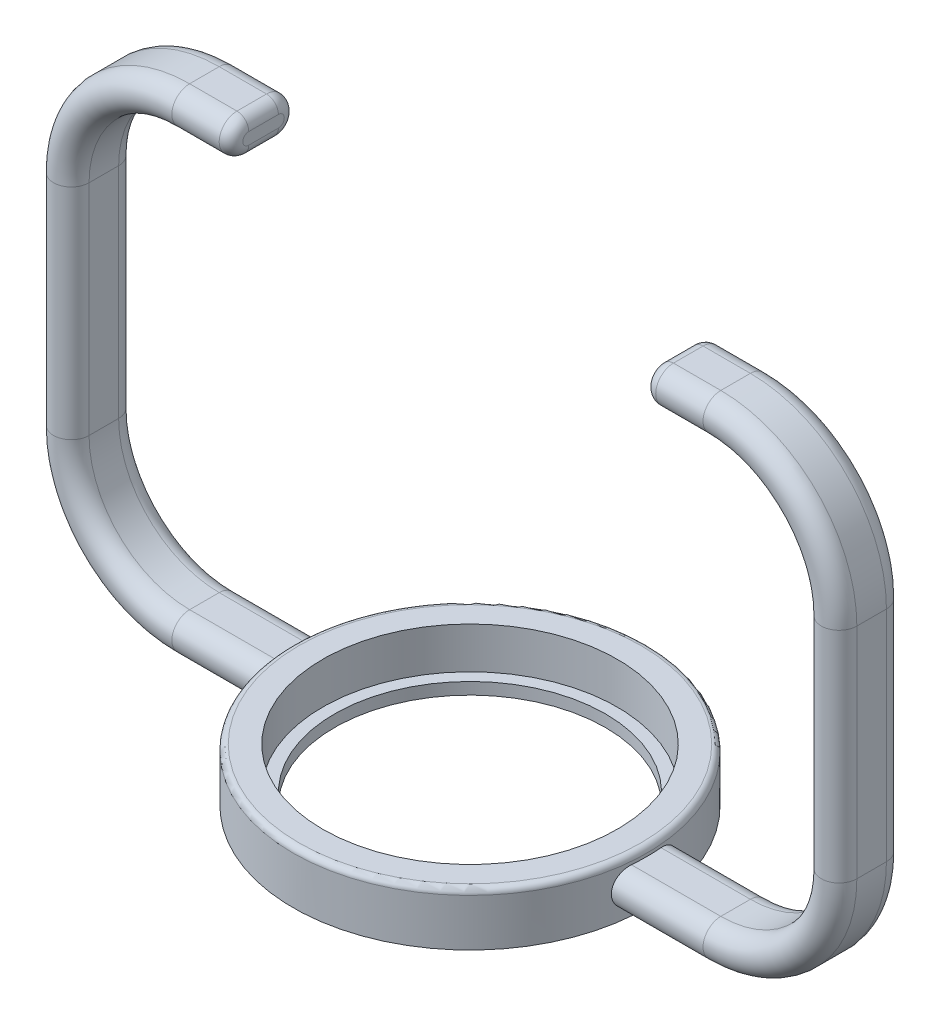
ISO-10303-21;
HEADER;
FILE_DESCRIPTION(('STEP AP214'),'2;1');
FILE_NAME('part.step','',(''),(''),'','','');
FILE_SCHEMA(('AUTOMOTIVE_DESIGN { 1 0 10303 214 1 1 1 1 }'));
ENDSEC;
DATA;
#1=APPLICATION_CONTEXT('core data for automotive mechanical design processes');
#2=APPLICATION_PROTOCOL_DEFINITION('international standard','automotive_design',2000,#1);
#3=PRODUCT_CONTEXT('',#1,'mechanical');
#4=PRODUCT('Part','Part','',(#3));
#5=PRODUCT_RELATED_PRODUCT_CATEGORY('part','',(#4));
#6=PRODUCT_DEFINITION_FORMATION('','',#4);
#7=PRODUCT_DEFINITION_CONTEXT('part definition',#1,'design');
#8=PRODUCT_DEFINITION('design','',#6,#7);
#9=PRODUCT_DEFINITION_SHAPE('','',#8);
#10=(LENGTH_UNIT() NAMED_UNIT(*) SI_UNIT(.MILLI.,.METRE.));
#11=(NAMED_UNIT(*) PLANE_ANGLE_UNIT() SI_UNIT($,.RADIAN.));
#12=(NAMED_UNIT(*) SI_UNIT($,.STERADIAN.) SOLID_ANGLE_UNIT());
#13=UNCERTAINTY_MEASURE_WITH_UNIT(LENGTH_MEASURE(1.E-05),#10,'distance_accuracy_value','');
#14=(GEOMETRIC_REPRESENTATION_CONTEXT(3) GLOBAL_UNCERTAINTY_ASSIGNED_CONTEXT((#13)) GLOBAL_UNIT_ASSIGNED_CONTEXT((#10,
#11,#12)) REPRESENTATION_CONTEXT('',''));
#15=CARTESIAN_POINT('',(0.,0.,0.));
#16=DIRECTION('',(0.,0.,1.));
#17=DIRECTION('',(1.,0.,0.));
#18=AXIS2_PLACEMENT_3D('',#15,#16,#17);
#19=CARTESIAN_POINT('',(0.,7.,0.));
#20=DIRECTION('',(0.,1.,0.));
#21=DIRECTION('',(0.,0.,1.));
#22=AXIS2_PLACEMENT_3D('',#19,#20,#21);
#23=PLANE('',#22);
#24=CARTESIAN_POINT('',(0.,7.,0.));
#25=DIRECTION('',(0.,1.,0.));
#26=DIRECTION('',(0.,0.,1.));
#27=AXIS2_PLACEMENT_3D('',#24,#25,#26);
#28=CIRCLE('',#27,28.9);
#29=CARTESIAN_POINT('',(0.,7.,28.9));
#30=VERTEX_POINT('',#29);
#31=EDGE_CURVE('E502',#30,#30,#28,.T.);
#32=ORIENTED_EDGE('',*,*,#31,.T.);
#33=EDGE_LOOP('',(#32));
#34=FACE_BOUND('',#33,.T.);
#35=CARTESIAN_POINT('',(0.,7.,0.));
#36=DIRECTION('',(0.,1.,0.));
#37=DIRECTION('',(0.,0.,1.));
#38=AXIS2_PLACEMENT_3D('',#35,#36,#37);
#39=CIRCLE('',#38,24.9);
#40=CARTESIAN_POINT('',(0.,7.,24.9));
#41=VERTEX_POINT('',#40);
#42=EDGE_CURVE('E499',#41,#41,#39,.T.);
#43=ORIENTED_EDGE('',*,*,#42,.F.);
#44=EDGE_LOOP('',(#43));
#45=FACE_BOUND('',#44,.T.);
#46=ADVANCED_FACE('F36',(#34,#45),#23,.T.);
#47=CARTESIAN_POINT('',(0.,7.,0.));
#48=DIRECTION('',(0.,-1.,0.));
#49=DIRECTION('',(0.,0.,-1.));
#50=AXIS2_PLACEMENT_3D('',#47,#48,#49);
#51=CYLINDRICAL_SURFACE('',#50,29.9);
#52=CARTESIAN_POINT('',(0.,5.50000000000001,0.));
#53=DIRECTION('',(0.,1.,0.));
#54=DIRECTION('',(-1.,0.,0.));
#55=AXIS2_PLACEMENT_3D('',#52,#53,#54);
#56=CIRCLE('',#55,29.9);
#57=CARTESIAN_POINT('',(29.7953016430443,5.50000000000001,2.5));
#58=VERTEX_POINT('',#57);
#59=CARTESIAN_POINT('',(29.7953016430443,5.50000000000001,-2.5));
#60=VERTEX_POINT('',#59);
#61=EDGE_CURVE('E606',#58,#60,#56,.T.);
#62=ORIENTED_EDGE('',*,*,#61,.T.);
#63=CARTESIAN_POINT('',(29.7953016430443,-0.5,-2.5));
#64=CARTESIAN_POINT('',(29.8093630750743,-0.499992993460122,-2.33239173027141));
#65=CARTESIAN_POINT('',(29.8220080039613,-0.485908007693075,-2.16455848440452));
#66=CARTESIAN_POINT('',(29.8442067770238,-0.429808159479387,-1.83329267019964));
#67=CARTESIAN_POINT('',(29.8537575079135,-0.387765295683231,-1.66986468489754));
#68=CARTESIAN_POINT('',(29.8698289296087,-0.276861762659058,-1.35225758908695));
#69=CARTESIAN_POINT('',(29.8763505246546,-0.208009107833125,-1.19807573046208));
#70=CARTESIAN_POINT('',(29.8867136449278,-0.0454186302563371,-0.903390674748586));
#71=CARTESIAN_POINT('',(29.8905556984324,0.0483142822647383,-0.762884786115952));
#72=CARTESIAN_POINT('',(29.8961138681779,0.257882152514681,-0.499708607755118));
#73=CARTESIAN_POINT('',(29.8978327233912,0.373688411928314,-0.377015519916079));
#74=CARTESIAN_POINT('',(29.8998208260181,0.624209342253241,-0.152729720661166));
#75=CARTESIAN_POINT('',(29.9000900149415,0.758924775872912,-0.0511378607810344));
#76=CARTESIAN_POINT('',(29.899860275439,1.04373425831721,0.128244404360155));
#77=CARTESIAN_POINT('',(29.8993598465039,1.19385781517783,0.205987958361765));
#78=CARTESIAN_POINT('',(29.8981912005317,1.50501400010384,0.33520406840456));
#79=CARTESIAN_POINT('',(29.8975229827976,1.66604667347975,0.386676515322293));
#80=CARTESIAN_POINT('',(29.8964553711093,1.99467496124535,0.461941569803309));
#81=CARTESIAN_POINT('',(29.8960563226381,2.16227871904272,0.485698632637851));
#82=CARTESIAN_POINT('',(29.8957410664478,2.49909596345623,0.50473815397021));
#83=CARTESIAN_POINT('',(29.8958248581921,2.66830944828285,0.500020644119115));
#84=CARTESIAN_POINT('',(29.8964325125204,3.0035295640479,0.462246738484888));
#85=CARTESIAN_POINT('',(29.8969563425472,3.16953643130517,0.429192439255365));
#86=CARTESIAN_POINT('',(29.8981518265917,3.49364611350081,0.335686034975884));
#87=CARTESIAN_POINT('',(29.8988234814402,3.6517488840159,0.275233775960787));
#88=CARTESIAN_POINT('',(29.8998126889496,3.95558179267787,0.12863768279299));
#89=CARTESIAN_POINT('',(29.9001302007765,4.10131050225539,0.0424908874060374));
#90=CARTESIAN_POINT('',(29.8997676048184,4.37623608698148,-0.153046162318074));
#91=CARTESIAN_POINT('',(29.899087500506,4.50543301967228,-0.262436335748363));
#92=CARTESIAN_POINT('',(29.8960355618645,4.74355215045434,-0.501276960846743));
#93=CARTESIAN_POINT('',(29.8936646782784,4.85248569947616,-0.630716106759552));
#94=CARTESIAN_POINT('',(29.8865872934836,5.04706679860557,-0.90599278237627));
#95=CARTESIAN_POINT('',(29.8818808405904,5.13271483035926,-1.05182997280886));
#96=CARTESIAN_POINT('',(29.8696491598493,5.27814861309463,-1.35538061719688));
#97=CARTESIAN_POINT('',(29.8621299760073,5.33798922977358,-1.51306803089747));
#98=CARTESIAN_POINT('',(29.8440114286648,5.43042750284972,-1.83606298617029));
#99=CARTESIAN_POINT('',(29.8334120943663,5.46302541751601,-2.00137045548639));
#100=CARTESIAN_POINT('',(29.8091656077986,5.50014610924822,-2.33486351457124));
#101=CARTESIAN_POINT('',(29.7955188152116,5.50467219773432,-2.50304876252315));
#102=CARTESIAN_POINT('',(29.7655230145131,5.48565110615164,-2.8375781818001));
#103=CARTESIAN_POINT('',(29.7491739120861,5.46210294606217,-3.00392228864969));
#104=CARTESIAN_POINT('',(29.7143186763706,5.3874784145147,-3.33114284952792));
#105=CARTESIAN_POINT('',(29.6958001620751,5.33623734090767,-3.49198040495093));
#106=CARTESIAN_POINT('',(29.6576125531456,5.20762685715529,-3.80270252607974));
#107=CARTESIAN_POINT('',(29.6379433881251,5.13025584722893,-3.95258642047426));
#108=CARTESIAN_POINT('',(29.5984149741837,4.95078614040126,-4.23849713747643));
#109=CARTESIAN_POINT('',(29.5785555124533,4.8484858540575,-4.37439744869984));
#110=CARTESIAN_POINT('',(29.5400808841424,4.62231653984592,-4.62709301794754));
#111=CARTESIAN_POINT('',(29.5214657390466,4.49844713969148,-4.74388794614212));
#112=CARTESIAN_POINT('',(29.4867603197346,4.23251117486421,-4.95504278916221));
#113=CARTESIAN_POINT('',(29.4706705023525,4.09044132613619,-5.0493986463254));
#114=CARTESIAN_POINT('',(29.4422038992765,3.79209307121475,-5.21282478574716));
#115=CARTESIAN_POINT('',(29.4298268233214,3.63581577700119,-5.28189704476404));
#116=CARTESIAN_POINT('',(29.4098654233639,3.31551036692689,-5.39193152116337));
#117=CARTESIAN_POINT('',(29.4022244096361,3.15160022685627,-5.43322675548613));
#118=CARTESIAN_POINT('',(29.3920985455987,2.81902476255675,-5.48774336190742));
#119=CARTESIAN_POINT('',(29.3896132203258,2.65035987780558,-5.50096732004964));
#120=CARTESIAN_POINT('',(29.3899931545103,2.31551559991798,-5.49893606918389));
#121=CARTESIAN_POINT('',(29.3927859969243,2.14933364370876,-5.48406630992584));
#122=CARTESIAN_POINT('',(29.4033616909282,1.82187984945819,-5.42707556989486));
#123=CARTESIAN_POINT('',(29.4111445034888,1.66060797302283,-5.38495480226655));
#124=CARTESIAN_POINT('',(29.4311036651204,1.34754280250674,-5.27477457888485));
#125=CARTESIAN_POINT('',(29.4432786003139,1.19574647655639,-5.20672347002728));
#126=CARTESIAN_POINT('',(29.471129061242,0.905701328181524,-5.04669400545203));
#127=CARTESIAN_POINT('',(29.4868047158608,0.76745300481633,-4.95471476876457));
#128=CARTESIAN_POINT('',(29.5207856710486,0.506463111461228,-4.74808265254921));
#129=CARTESIAN_POINT('',(29.5391227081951,0.383948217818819,-4.63314873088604));
#130=CARTESIAN_POINT('',(29.5770413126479,0.159822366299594,-4.3845644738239));
#131=CARTESIAN_POINT('',(29.5966232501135,0.0582176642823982,-4.25090855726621));
#132=CARTESIAN_POINT('',(29.6360619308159,-0.122507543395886,-3.96669506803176));
#133=CARTESIAN_POINT('',(29.6559188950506,-0.201314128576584,-3.81593798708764));
#134=CARTESIAN_POINT('',(29.6944741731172,-0.332334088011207,-3.50327254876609));
#135=CARTESIAN_POINT('',(29.7131737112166,-0.384575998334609,-3.3413763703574));
#136=CARTESIAN_POINT('',(29.7426440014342,-0.448404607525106,-3.06554774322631));
#137=CARTESIAN_POINT('',(29.7539958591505,-0.467716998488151,-2.95340459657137));
#138=CARTESIAN_POINT('',(29.7755501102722,-0.493517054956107,-2.72754221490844));
#139=CARTESIAN_POINT('',(29.7857525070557,-0.500004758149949,-2.61382298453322));
#140=CARTESIAN_POINT('',(29.7953016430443,-0.5,-2.5));
#141=B_SPLINE_CURVE_WITH_KNOTS('',3,(#63,#64,#65,#66,#67,#68,#69,#70,#71,#72,#73,#74,#75,#76,
#77,#78,#79,#80,#81,#82,#83,#84,#85,#86,#87,#88,#89,#90,#91,#92,#93,#94,#95,#96,#97,#98,#99,
#100,#101,#102,#103,#104,#105,#106,#107,#108,#109,#110,#111,#112,#113,#114,#115,#116,#117,#118,
#119,#120,#121,#122,#123,#124,#125,#126,#127,#128,#129,#130,#131,#132,#133,#134,#135,#136,#137,
#138,#139,#140),.UNSPECIFIED.,.T.,.F.,(4,2,2,2,2,2,2,2,2,2,2,2,2,2,2,2,2,2,2,2,2,2,2,2,2,2,2,2,
2,2,2,2,2,2,2,2,2,2,4),(0.,0.504178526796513,1.00886277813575,1.51339627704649,2.01783027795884,
2.52161286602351,3.0254157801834,3.53020219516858,4.03499070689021,4.54042589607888,
5.04586052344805,5.55125775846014,6.05665783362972,6.56211617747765,7.06757276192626,
7.57274534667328,8.07790748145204,8.58199029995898,9.08606833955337,9.59008691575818,
10.0941230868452,10.6011905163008,11.1082889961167,11.6196327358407,12.1309853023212,
12.6424302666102,13.153835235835,13.6589941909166,14.1641066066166,14.662339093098,
15.1605676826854,15.6586360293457,16.1567227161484,16.6613294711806,17.166086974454,
17.6774957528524,18.1883540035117,18.5307432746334,18.873131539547),.UNSPECIFIED.);
#142=CARTESIAN_POINT('',(29.7953016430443,-0.5,-2.5));
#143=VERTEX_POINT('',#142);
#144=EDGE_CURVE('E11',#60,#143,#141,.T.);
#145=ORIENTED_EDGE('',*,*,#144,.T.);
#146=CARTESIAN_POINT('',(0.,-0.499999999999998,0.));
#147=DIRECTION('',(0.,-1.,0.));
#148=DIRECTION('',(1.,0.,0.));
#149=AXIS2_PLACEMENT_3D('',#146,#147,#148);
#150=CIRCLE('',#149,29.9);
#151=CARTESIAN_POINT('',(29.7953016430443,-0.5,2.5));
#152=VERTEX_POINT('',#151);
#153=EDGE_CURVE('E47',#143,#152,#150,.T.);
#154=ORIENTED_EDGE('',*,*,#153,.T.);
#155=CARTESIAN_POINT('',(29.7953016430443,-0.5,2.5));
#156=CARTESIAN_POINT('',(29.7810877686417,-0.499992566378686,2.66937822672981));
#157=CARTESIAN_POINT('',(29.7654083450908,-0.485607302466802,2.83875122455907));
#158=CARTESIAN_POINT('',(29.7316852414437,-0.428549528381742,3.17255936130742));
#159=CARTESIAN_POINT('',(29.7136387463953,-0.385843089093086,3.3369883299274));
#160=CARTESIAN_POINT('',(29.6760696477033,-0.273468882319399,3.65604655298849));
#161=CARTESIAN_POINT('',(29.6565481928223,-0.203821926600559,3.81068326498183));
#162=CARTESIAN_POINT('',(29.617110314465,-0.0395673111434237,4.10597051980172));
#163=CARTESIAN_POINT('',(29.5971939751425,0.0550350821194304,4.24662400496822));
#164=CARTESIAN_POINT('',(29.5580981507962,0.267121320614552,4.51073942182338));
#165=CARTESIAN_POINT('',(29.5389226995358,0.384713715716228,4.63411483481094));
#166=CARTESIAN_POINT('',(29.5027079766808,0.639259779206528,4.85934855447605));
#167=CARTESIAN_POINT('',(29.4856687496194,0.776213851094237,4.96120641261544));
#168=CARTESIAN_POINT('',(29.4550264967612,1.0650432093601,5.14000360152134));
#169=CARTESIAN_POINT('',(29.4414087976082,1.21685076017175,5.21704975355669));
#170=CARTESIAN_POINT('',(29.4185469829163,1.53158367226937,5.34446555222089));
#171=CARTESIAN_POINT('',(29.4093024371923,1.69450793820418,5.39483782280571));
#172=CARTESIAN_POINT('',(29.3960139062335,2.02430999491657,5.46678128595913));
#173=CARTESIAN_POINT('',(29.3918961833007,2.19109572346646,5.48876101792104));
#174=CARTESIAN_POINT('',(29.3889402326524,2.52603656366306,5.50456742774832));
#175=CARTESIAN_POINT('',(29.3901016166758,2.69419157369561,5.49839617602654));
#176=CARTESIAN_POINT('',(29.3975719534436,3.02528052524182,5.45831120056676));
#177=CARTESIAN_POINT('',(29.4038279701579,3.18825033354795,5.42468276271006));
#178=CARTESIAN_POINT('',(29.4209406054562,3.50618300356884,5.33108787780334));
#179=CARTESIAN_POINT('',(29.4317973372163,3.66114566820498,5.27112078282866));
#180=CARTESIAN_POINT('',(29.4573740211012,3.95959798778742,5.12625853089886));
#181=CARTESIAN_POINT('',(29.4721138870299,4.10302337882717,5.04123460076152));
#182=CARTESIAN_POINT('',(29.5043778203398,4.3736480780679,4.84883243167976));
#183=CARTESIAN_POINT('',(29.5219021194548,4.50084603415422,4.74145233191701));
#184=CARTESIAN_POINT('',(29.5588279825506,4.73741402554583,4.50556517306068));
#185=CARTESIAN_POINT('',(29.5782536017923,4.84649059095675,4.37676749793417));
#186=CARTESIAN_POINT('',(29.617501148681,5.0415348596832,4.10277373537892));
#187=CARTESIAN_POINT('',(29.6373231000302,5.12750117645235,3.95757666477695));
#188=CARTESIAN_POINT('',(29.6763679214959,5.27463861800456,3.65334041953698));
#189=CARTESIAN_POINT('',(29.6955834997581,5.33557154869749,3.49418500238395));
#190=CARTESIAN_POINT('',(29.7321854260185,5.42969044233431,3.16766763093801));
#191=CARTESIAN_POINT('',(29.7495718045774,5.46287686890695,3.00030581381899));
#192=CARTESIAN_POINT('',(29.7816856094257,5.50038164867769,2.66267847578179));
#193=CARTESIAN_POINT('',(29.7964215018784,5.50479356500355,2.49242417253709));
#194=CARTESIAN_POINT('',(29.822840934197,5.48474307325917,2.15338539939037));
#195=CARTESIAN_POINT('',(29.8345246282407,5.46028212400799,1.9846008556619));
#196=CARTESIAN_POINT('',(29.8546227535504,5.38342727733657,1.65486154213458));
#197=CARTESIAN_POINT('',(29.8630645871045,5.33127680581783,1.49385167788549));
#198=CARTESIAN_POINT('',(29.8770031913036,5.20062265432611,1.18276966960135));
#199=CARTESIAN_POINT('',(29.8825000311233,5.12211959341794,1.03269726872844));
#200=CARTESIAN_POINT('',(29.8909688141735,4.94136469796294,0.748432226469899));
#201=CARTESIAN_POINT('',(29.8939513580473,4.83921490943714,0.614174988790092));
#202=CARTESIAN_POINT('',(29.8980375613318,4.61387372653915,0.364630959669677));
#203=CARTESIAN_POINT('',(29.8991412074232,4.49068218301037,0.249344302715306));
#204=CARTESIAN_POINT('',(29.9001545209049,4.22657737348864,0.0408806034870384));
#205=CARTESIAN_POINT('',(29.9000627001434,4.08564223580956,-0.0522687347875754));
#206=CARTESIAN_POINT('',(29.8993461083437,3.79015857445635,-0.213637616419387));
#207=CARTESIAN_POINT('',(29.8987213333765,3.63560995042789,-0.281856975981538));
#208=CARTESIAN_POINT('',(29.8974870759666,3.316977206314,-0.391537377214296));
#209=CARTESIAN_POINT('',(29.8968776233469,3.15287628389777,-0.432949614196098));
#210=CARTESIAN_POINT('',(29.8960359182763,2.8200504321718,-0.487642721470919));
#211=CARTESIAN_POINT('',(29.8958036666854,2.65132549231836,-0.500923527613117));
#212=CARTESIAN_POINT('',(29.8958362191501,2.31401219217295,-0.498976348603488));
#213=CARTESIAN_POINT('',(29.8961011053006,2.1454238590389,-0.483743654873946));
#214=CARTESIAN_POINT('',(29.8969907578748,1.81319726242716,-0.425192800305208));
#215=CARTESIAN_POINT('',(29.897615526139,1.64955902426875,-0.381874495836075));
#216=CARTESIAN_POINT('',(29.8988489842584,1.331873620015,-0.268380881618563));
#217=CARTESIAN_POINT('',(29.8994576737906,1.17782664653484,-0.198205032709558));
#218=CARTESIAN_POINT('',(29.9000954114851,0.883703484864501,-0.0329893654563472));
#219=CARTESIAN_POINT('',(29.9001244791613,0.743626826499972,0.0620496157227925));
#220=CARTESIAN_POINT('',(29.8989297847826,0.48144784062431,0.274267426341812));
#221=CARTESIAN_POINT('',(29.8977063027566,0.359341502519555,0.391441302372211));
#222=CARTESIAN_POINT('',(29.8933176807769,0.136516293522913,0.64463349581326));
#223=CARTESIAN_POINT('',(29.8901521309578,0.0358019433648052,0.780655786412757));
#224=CARTESIAN_POINT('',(29.8812847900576,-0.141218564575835,1.0674049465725));
#225=CARTESIAN_POINT('',(29.8755864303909,-0.217557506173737,1.21811170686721));
#226=CARTESIAN_POINT('',(29.8612378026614,-0.343805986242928,1.52994775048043));
#227=CARTESIAN_POINT('',(29.8525908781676,-0.393745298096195,1.69106506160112));
#228=CARTESIAN_POINT('',(29.835818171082,-0.453168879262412,1.96093907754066));
#229=CARTESIAN_POINT('',(29.8285910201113,-0.470715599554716,2.06804617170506));
#230=CARTESIAN_POINT('',(29.8128761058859,-0.494133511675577,2.28343622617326));
#231=CARTESIAN_POINT('',(29.8043883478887,-0.500004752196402,2.39171918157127));
#232=CARTESIAN_POINT('',(29.7953016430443,-0.5,2.5));
#233=B_SPLINE_CURVE_WITH_KNOTS('',3,(#155,#156,#157,#158,#159,#160,#161,#162,#163,#164,#165,
#166,#167,#168,#169,#170,#171,#172,#173,#174,#175,#176,#177,#178,#179,#180,#181,#182,#183,#184,
#185,#186,#187,#188,#189,#190,#191,#192,#193,#194,#195,#196,#197,#198,#199,#200,#201,#202,#203,
#204,#205,#206,#207,#208,#209,#210,#211,#212,#213,#214,#215,#216,#217,#218,#219,#220,#221,#222,
#223,#224,#225,#226,#227,#228,#229,#230,#231,#232),.UNSPECIFIED.,.T.,.F.,(4,2,2,2,2,2,2,2,2,2,2,
2,2,2,2,2,2,2,2,2,2,2,2,2,2,2,2,2,2,2,2,2,2,2,2,2,2,2,4),(0.,0.509521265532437,1.01965404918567,
1.52939353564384,2.03902553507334,2.55112461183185,3.06323436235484,3.57310891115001,
4.08293329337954,4.58533697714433,5.087703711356,5.58491619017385,6.08214090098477,
6.58196690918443,7.08183453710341,7.58914081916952,8.09647753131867,8.60853561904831,
9.1205851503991,9.63096886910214,10.1413268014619,10.6472705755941,11.153202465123,
11.6569904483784,12.1607820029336,12.6652007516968,13.1696232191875,13.6749614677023,
14.1803008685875,14.6857237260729,15.1911491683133,15.6965847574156,16.2020033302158,
16.7073089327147,17.212721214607,17.717450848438,18.2216100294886,18.5473402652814,
18.8730691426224),.UNSPECIFIED.);
#234=EDGE_CURVE('E229',#152,#58,#233,.T.);
#235=ORIENTED_EDGE('',*,*,#234,.T.);
#236=EDGE_LOOP('',(#62,#145,#154,#235));
#237=FACE_BOUND('',#236,.T.);
#238=CARTESIAN_POINT('',(0.,-0.499999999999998,0.));
#239=DIRECTION('',(0.,-1.,0.));
#240=DIRECTION('',(1.,0.,0.));
#241=AXIS2_PLACEMENT_3D('',#238,#239,#240);
#242=CIRCLE('',#241,29.9);
#243=CARTESIAN_POINT('',(-29.7953016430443,-0.5,2.5));
#244=VERTEX_POINT('',#243);
#245=CARTESIAN_POINT('',(-29.7953016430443,-0.5,-2.5));
#246=VERTEX_POINT('',#245);
#247=EDGE_CURVE('E601',#244,#246,#242,.T.);
#248=ORIENTED_EDGE('',*,*,#247,.T.);
#249=CARTESIAN_POINT('',(-29.7953016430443,-0.5,-2.5));
#250=CARTESIAN_POINT('',(-29.7810877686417,-0.499992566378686,-2.66937822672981));
#251=CARTESIAN_POINT('',(-29.7654083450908,-0.485607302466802,-2.83875122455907));
#252=CARTESIAN_POINT('',(-29.7316852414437,-0.428549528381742,-3.17255936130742));
#253=CARTESIAN_POINT('',(-29.7136387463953,-0.385843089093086,-3.3369883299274));
#254=CARTESIAN_POINT('',(-29.6760696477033,-0.273468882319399,-3.65604655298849));
#255=CARTESIAN_POINT('',(-29.6565481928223,-0.203821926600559,-3.81068326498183));
#256=CARTESIAN_POINT('',(-29.617110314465,-0.0395673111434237,-4.10597051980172));
#257=CARTESIAN_POINT('',(-29.5971939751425,0.0550350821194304,-4.24662400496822));
#258=CARTESIAN_POINT('',(-29.5580981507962,0.267121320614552,-4.51073942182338));
#259=CARTESIAN_POINT('',(-29.5389226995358,0.384713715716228,-4.63411483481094));
#260=CARTESIAN_POINT('',(-29.5027079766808,0.639259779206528,-4.85934855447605));
#261=CARTESIAN_POINT('',(-29.4856687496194,0.776213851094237,-4.96120641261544));
#262=CARTESIAN_POINT('',(-29.4550264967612,1.0650432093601,-5.14000360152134));
#263=CARTESIAN_POINT('',(-29.4414087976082,1.21685076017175,-5.21704975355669));
#264=CARTESIAN_POINT('',(-29.4185469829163,1.53158367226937,-5.34446555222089));
#265=CARTESIAN_POINT('',(-29.4093024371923,1.69450793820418,-5.39483782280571));
#266=CARTESIAN_POINT('',(-29.3960139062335,2.02430999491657,-5.46678128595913));
#267=CARTESIAN_POINT('',(-29.3918961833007,2.19109572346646,-5.48876101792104));
#268=CARTESIAN_POINT('',(-29.3889402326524,2.52603656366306,-5.50456742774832));
#269=CARTESIAN_POINT('',(-29.3901016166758,2.69419157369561,-5.49839617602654));
#270=CARTESIAN_POINT('',(-29.3975719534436,3.02528052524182,-5.45831120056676));
#271=CARTESIAN_POINT('',(-29.4038279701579,3.18825033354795,-5.42468276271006));
#272=CARTESIAN_POINT('',(-29.4209406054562,3.50618300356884,-5.33108787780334));
#273=CARTESIAN_POINT('',(-29.4317973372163,3.66114566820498,-5.27112078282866));
#274=CARTESIAN_POINT('',(-29.4573740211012,3.95959798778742,-5.12625853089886));
#275=CARTESIAN_POINT('',(-29.4721138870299,4.10302337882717,-5.04123460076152));
#276=CARTESIAN_POINT('',(-29.5043778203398,4.3736480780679,-4.84883243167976));
#277=CARTESIAN_POINT('',(-29.5219021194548,4.50084603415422,-4.74145233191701));
#278=CARTESIAN_POINT('',(-29.5588279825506,4.73741402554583,-4.50556517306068));
#279=CARTESIAN_POINT('',(-29.5782536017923,4.84649059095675,-4.37676749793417));
#280=CARTESIAN_POINT('',(-29.617501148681,5.0415348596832,-4.10277373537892));
#281=CARTESIAN_POINT('',(-29.6373231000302,5.12750117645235,-3.95757666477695));
#282=CARTESIAN_POINT('',(-29.6763679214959,5.27463861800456,-3.65334041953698));
#283=CARTESIAN_POINT('',(-29.6955834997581,5.33557154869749,-3.49418500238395));
#284=CARTESIAN_POINT('',(-29.7321854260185,5.42969044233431,-3.16766763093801));
#285=CARTESIAN_POINT('',(-29.7495718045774,5.46287686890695,-3.00030581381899));
#286=CARTESIAN_POINT('',(-29.7816856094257,5.50038164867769,-2.66267847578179));
#287=CARTESIAN_POINT('',(-29.7964215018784,5.50479356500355,-2.49242417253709));
#288=CARTESIAN_POINT('',(-29.822840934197,5.48474307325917,-2.15338539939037));
#289=CARTESIAN_POINT('',(-29.8345246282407,5.46028212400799,-1.9846008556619));
#290=CARTESIAN_POINT('',(-29.8546227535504,5.38342727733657,-1.65486154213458));
#291=CARTESIAN_POINT('',(-29.8630645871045,5.33127680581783,-1.49385167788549));
#292=CARTESIAN_POINT('',(-29.8770031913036,5.20062265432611,-1.18276966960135));
#293=CARTESIAN_POINT('',(-29.8825000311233,5.12211959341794,-1.03269726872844));
#294=CARTESIAN_POINT('',(-29.8909688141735,4.94136469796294,-0.748432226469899));
#295=CARTESIAN_POINT('',(-29.8939513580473,4.83921490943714,-0.614174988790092));
#296=CARTESIAN_POINT('',(-29.8980375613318,4.61387372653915,-0.364630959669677));
#297=CARTESIAN_POINT('',(-29.8991412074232,4.49068218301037,-0.249344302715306));
#298=CARTESIAN_POINT('',(-29.9001545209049,4.22657737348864,-0.0408806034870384));
#299=CARTESIAN_POINT('',(-29.9000627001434,4.08564223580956,0.0522687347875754));
#300=CARTESIAN_POINT('',(-29.8993461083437,3.79015857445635,0.213637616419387));
#301=CARTESIAN_POINT('',(-29.8987213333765,3.63560995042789,0.281856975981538));
#302=CARTESIAN_POINT('',(-29.8974870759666,3.316977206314,0.391537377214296));
#303=CARTESIAN_POINT('',(-29.8968776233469,3.15287628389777,0.432949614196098));
#304=CARTESIAN_POINT('',(-29.8960359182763,2.8200504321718,0.487642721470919));
#305=CARTESIAN_POINT('',(-29.8958036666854,2.65132549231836,0.500923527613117));
#306=CARTESIAN_POINT('',(-29.8958362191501,2.31401219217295,0.498976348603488));
#307=CARTESIAN_POINT('',(-29.8961011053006,2.1454238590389,0.483743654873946));
#308=CARTESIAN_POINT('',(-29.8969907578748,1.81319726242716,0.425192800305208));
#309=CARTESIAN_POINT('',(-29.897615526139,1.64955902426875,0.381874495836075));
#310=CARTESIAN_POINT('',(-29.8988489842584,1.331873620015,0.268380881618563));
#311=CARTESIAN_POINT('',(-29.8994576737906,1.17782664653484,0.198205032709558));
#312=CARTESIAN_POINT('',(-29.9000954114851,0.883703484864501,0.0329893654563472));
#313=CARTESIAN_POINT('',(-29.9001244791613,0.743626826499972,-0.0620496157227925));
#314=CARTESIAN_POINT('',(-29.8989297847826,0.48144784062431,-0.274267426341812));
#315=CARTESIAN_POINT('',(-29.8977063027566,0.359341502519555,-0.391441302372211));
#316=CARTESIAN_POINT('',(-29.8933176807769,0.136516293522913,-0.64463349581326));
#317=CARTESIAN_POINT('',(-29.8901521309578,0.0358019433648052,-0.780655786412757));
#318=CARTESIAN_POINT('',(-29.8812847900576,-0.141218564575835,-1.0674049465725));
#319=CARTESIAN_POINT('',(-29.8755864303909,-0.217557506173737,-1.21811170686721));
#320=CARTESIAN_POINT('',(-29.8612378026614,-0.343805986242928,-1.52994775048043));
#321=CARTESIAN_POINT('',(-29.8525908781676,-0.393745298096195,-1.69106506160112));
#322=CARTESIAN_POINT('',(-29.835818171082,-0.453168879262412,-1.96093907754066));
#323=CARTESIAN_POINT('',(-29.8285910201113,-0.470715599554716,-2.06804617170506));
#324=CARTESIAN_POINT('',(-29.8128761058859,-0.494133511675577,-2.28343622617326));
#325=CARTESIAN_POINT('',(-29.8043883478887,-0.500004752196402,-2.39171918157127));
#326=CARTESIAN_POINT('',(-29.7953016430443,-0.5,-2.5));
#327=B_SPLINE_CURVE_WITH_KNOTS('',3,(#249,#250,#251,#252,#253,#254,#255,#256,#257,#258,#259,
#260,#261,#262,#263,#264,#265,#266,#267,#268,#269,#270,#271,#272,#273,#274,#275,#276,#277,#278,
#279,#280,#281,#282,#283,#284,#285,#286,#287,#288,#289,#290,#291,#292,#293,#294,#295,#296,#297,
#298,#299,#300,#301,#302,#303,#304,#305,#306,#307,#308,#309,#310,#311,#312,#313,#314,#315,#316,
#317,#318,#319,#320,#321,#322,#323,#324,#325,#326),.UNSPECIFIED.,.T.,.F.,(4,2,2,2,2,2,2,2,2,2,2,
2,2,2,2,2,2,2,2,2,2,2,2,2,2,2,2,2,2,2,2,2,2,2,2,2,2,2,4),(0.,0.509521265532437,1.01965404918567,
1.52939353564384,2.03902553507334,2.55112461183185,3.06323436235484,3.57310891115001,
4.08293329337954,4.58533697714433,5.087703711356,5.58491619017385,6.08214090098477,
6.58196690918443,7.08183453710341,7.58914081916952,8.09647753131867,8.60853561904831,
9.1205851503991,9.63096886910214,10.1413268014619,10.6472705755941,11.153202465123,
11.6569904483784,12.1607820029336,12.6652007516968,13.1696232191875,13.6749614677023,
14.1803008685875,14.6857237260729,15.1911491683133,15.6965847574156,16.2020033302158,
16.7073089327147,17.212721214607,17.717450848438,18.2216100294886,18.5473402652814,
18.8730691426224),.UNSPECIFIED.);
#328=CARTESIAN_POINT('',(-29.7953016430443,5.50000000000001,-2.5));
#329=VERTEX_POINT('',#328);
#330=EDGE_CURVE('E596',#246,#329,#327,.T.);
#331=ORIENTED_EDGE('',*,*,#330,.T.);
#332=CARTESIAN_POINT('',(0.,5.50000000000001,0.));
#333=DIRECTION('',(0.,1.,0.));
#334=DIRECTION('',(-1.,0.,0.));
#335=AXIS2_PLACEMENT_3D('',#332,#333,#334);
#336=CIRCLE('',#335,29.9);
#337=CARTESIAN_POINT('',(-29.7953016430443,5.50000000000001,2.5));
#338=VERTEX_POINT('',#337);
#339=EDGE_CURVE('E516',#329,#338,#336,.T.);
#340=ORIENTED_EDGE('',*,*,#339,.T.);
#341=CARTESIAN_POINT('',(-29.7953016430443,-0.5,2.5));
#342=CARTESIAN_POINT('',(-29.8093630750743,-0.499992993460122,2.33239173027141));
#343=CARTESIAN_POINT('',(-29.8220080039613,-0.485908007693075,2.16455848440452));
#344=CARTESIAN_POINT('',(-29.8442067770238,-0.429808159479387,1.83329267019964));
#345=CARTESIAN_POINT('',(-29.8537575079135,-0.387765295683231,1.66986468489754));
#346=CARTESIAN_POINT('',(-29.8698289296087,-0.276861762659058,1.35225758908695));
#347=CARTESIAN_POINT('',(-29.8763505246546,-0.208009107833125,1.19807573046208));
#348=CARTESIAN_POINT('',(-29.8867136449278,-0.0454186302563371,0.903390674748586));
#349=CARTESIAN_POINT('',(-29.8905556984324,0.0483142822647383,0.762884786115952));
#350=CARTESIAN_POINT('',(-29.8961138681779,0.257882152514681,0.499708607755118));
#351=CARTESIAN_POINT('',(-29.8978327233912,0.373688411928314,0.377015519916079));
#352=CARTESIAN_POINT('',(-29.8998208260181,0.624209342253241,0.152729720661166));
#353=CARTESIAN_POINT('',(-29.9000900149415,0.758924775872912,0.0511378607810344));
#354=CARTESIAN_POINT('',(-29.899860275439,1.04373425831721,-0.128244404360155));
#355=CARTESIAN_POINT('',(-29.8993598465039,1.19385781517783,-0.205987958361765));
#356=CARTESIAN_POINT('',(-29.8981912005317,1.50501400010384,-0.33520406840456));
#357=CARTESIAN_POINT('',(-29.8975229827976,1.66604667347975,-0.386676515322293));
#358=CARTESIAN_POINT('',(-29.8964553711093,1.99467496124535,-0.461941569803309));
#359=CARTESIAN_POINT('',(-29.8960563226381,2.16227871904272,-0.485698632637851));
#360=CARTESIAN_POINT('',(-29.8957410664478,2.49909596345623,-0.50473815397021));
#361=CARTESIAN_POINT('',(-29.8958248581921,2.66830944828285,-0.500020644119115));
#362=CARTESIAN_POINT('',(-29.8964325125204,3.0035295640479,-0.462246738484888));
#363=CARTESIAN_POINT('',(-29.8969563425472,3.16953643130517,-0.429192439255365));
#364=CARTESIAN_POINT('',(-29.8981518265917,3.49364611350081,-0.335686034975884));
#365=CARTESIAN_POINT('',(-29.8988234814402,3.6517488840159,-0.275233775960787));
#366=CARTESIAN_POINT('',(-29.8998126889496,3.95558179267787,-0.12863768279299));
#367=CARTESIAN_POINT('',(-29.9001302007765,4.10131050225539,-0.0424908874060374));
#368=CARTESIAN_POINT('',(-29.8997676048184,4.37623608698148,0.153046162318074));
#369=CARTESIAN_POINT('',(-29.899087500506,4.50543301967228,0.262436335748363));
#370=CARTESIAN_POINT('',(-29.8960355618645,4.74355215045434,0.501276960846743));
#371=CARTESIAN_POINT('',(-29.8936646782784,4.85248569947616,0.630716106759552));
#372=CARTESIAN_POINT('',(-29.8865872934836,5.04706679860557,0.90599278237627));
#373=CARTESIAN_POINT('',(-29.8818808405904,5.13271483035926,1.05182997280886));
#374=CARTESIAN_POINT('',(-29.8696491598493,5.27814861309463,1.35538061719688));
#375=CARTESIAN_POINT('',(-29.8621299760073,5.33798922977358,1.51306803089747));
#376=CARTESIAN_POINT('',(-29.8440114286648,5.43042750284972,1.83606298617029));
#377=CARTESIAN_POINT('',(-29.8334120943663,5.46302541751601,2.00137045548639));
#378=CARTESIAN_POINT('',(-29.8091656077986,5.50014610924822,2.33486351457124));
#379=CARTESIAN_POINT('',(-29.7955188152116,5.50467219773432,2.50304876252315));
#380=CARTESIAN_POINT('',(-29.7655230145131,5.48565110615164,2.8375781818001));
#381=CARTESIAN_POINT('',(-29.7491739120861,5.46210294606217,3.00392228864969));
#382=CARTESIAN_POINT('',(-29.7143186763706,5.3874784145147,3.33114284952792));
#383=CARTESIAN_POINT('',(-29.6958001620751,5.33623734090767,3.49198040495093));
#384=CARTESIAN_POINT('',(-29.6576125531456,5.20762685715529,3.80270252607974));
#385=CARTESIAN_POINT('',(-29.6379433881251,5.13025584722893,3.95258642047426));
#386=CARTESIAN_POINT('',(-29.5984149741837,4.95078614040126,4.23849713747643));
#387=CARTESIAN_POINT('',(-29.5785555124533,4.8484858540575,4.37439744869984));
#388=CARTESIAN_POINT('',(-29.5400808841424,4.62231653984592,4.62709301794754));
#389=CARTESIAN_POINT('',(-29.5214657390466,4.49844713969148,4.74388794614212));
#390=CARTESIAN_POINT('',(-29.4867603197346,4.23251117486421,4.95504278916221));
#391=CARTESIAN_POINT('',(-29.4706705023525,4.09044132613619,5.0493986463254));
#392=CARTESIAN_POINT('',(-29.4422038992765,3.79209307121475,5.21282478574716));
#393=CARTESIAN_POINT('',(-29.4298268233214,3.63581577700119,5.28189704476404));
#394=CARTESIAN_POINT('',(-29.4098654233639,3.31551036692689,5.39193152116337));
#395=CARTESIAN_POINT('',(-29.4022244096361,3.15160022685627,5.43322675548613));
#396=CARTESIAN_POINT('',(-29.3920985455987,2.81902476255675,5.48774336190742));
#397=CARTESIAN_POINT('',(-29.3896132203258,2.65035987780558,5.50096732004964));
#398=CARTESIAN_POINT('',(-29.3899931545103,2.31551559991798,5.49893606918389));
#399=CARTESIAN_POINT('',(-29.3927859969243,2.14933364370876,5.48406630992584));
#400=CARTESIAN_POINT('',(-29.4033616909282,1.82187984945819,5.42707556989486));
#401=CARTESIAN_POINT('',(-29.4111445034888,1.66060797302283,5.38495480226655));
#402=CARTESIAN_POINT('',(-29.4311036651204,1.34754280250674,5.27477457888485));
#403=CARTESIAN_POINT('',(-29.4432786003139,1.19574647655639,5.20672347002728));
#404=CARTESIAN_POINT('',(-29.471129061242,0.905701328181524,5.04669400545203));
#405=CARTESIAN_POINT('',(-29.4868047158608,0.76745300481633,4.95471476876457));
#406=CARTESIAN_POINT('',(-29.5207856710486,0.506463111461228,4.74808265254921));
#407=CARTESIAN_POINT('',(-29.5391227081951,0.383948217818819,4.63314873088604));
#408=CARTESIAN_POINT('',(-29.5770413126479,0.159822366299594,4.3845644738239));
#409=CARTESIAN_POINT('',(-29.5966232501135,0.0582176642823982,4.25090855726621));
#410=CARTESIAN_POINT('',(-29.6360619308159,-0.122507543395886,3.96669506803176));
#411=CARTESIAN_POINT('',(-29.6559188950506,-0.201314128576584,3.81593798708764));
#412=CARTESIAN_POINT('',(-29.6944741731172,-0.332334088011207,3.50327254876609));
#413=CARTESIAN_POINT('',(-29.7131737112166,-0.384575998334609,3.3413763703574));
#414=CARTESIAN_POINT('',(-29.7426440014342,-0.448404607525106,3.06554774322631));
#415=CARTESIAN_POINT('',(-29.7539958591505,-0.467716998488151,2.95340459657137));
#416=CARTESIAN_POINT('',(-29.7755501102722,-0.493517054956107,2.72754221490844));
#417=CARTESIAN_POINT('',(-29.7857525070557,-0.500004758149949,2.61382298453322));
#418=CARTESIAN_POINT('',(-29.7953016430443,-0.5,2.5));
#419=B_SPLINE_CURVE_WITH_KNOTS('',3,(#341,#342,#343,#344,#345,#346,#347,#348,#349,#350,#351,
#352,#353,#354,#355,#356,#357,#358,#359,#360,#361,#362,#363,#364,#365,#366,#367,#368,#369,#370,
#371,#372,#373,#374,#375,#376,#377,#378,#379,#380,#381,#382,#383,#384,#385,#386,#387,#388,#389,
#390,#391,#392,#393,#394,#395,#396,#397,#398,#399,#400,#401,#402,#403,#404,#405,#406,#407,#408,
#409,#410,#411,#412,#413,#414,#415,#416,#417,#418),.UNSPECIFIED.,.T.,.F.,(4,2,2,2,2,2,2,2,2,2,2,
2,2,2,2,2,2,2,2,2,2,2,2,2,2,2,2,2,2,2,2,2,2,2,2,2,2,2,4),(0.,0.504178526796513,1.00886277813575,
1.51339627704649,2.01783027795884,2.52161286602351,3.0254157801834,3.53020219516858,
4.03499070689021,4.54042589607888,5.04586052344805,5.55125775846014,6.05665783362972,
6.56211617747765,7.06757276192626,7.57274534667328,8.07790748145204,8.58199029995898,
9.08606833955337,9.59008691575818,10.0941230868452,10.6011905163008,11.1082889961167,
11.6196327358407,12.1309853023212,12.6424302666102,13.153835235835,13.6589941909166,
14.1641066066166,14.662339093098,15.1605676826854,15.6586360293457,16.1567227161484,
16.6613294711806,17.166086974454,17.6774957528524,18.1883540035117,18.5307432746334,
18.873131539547),.UNSPECIFIED.);
#420=EDGE_CURVE('E510',#338,#244,#419,.T.);
#421=ORIENTED_EDGE('',*,*,#420,.T.);
#422=EDGE_LOOP('',(#248,#331,#340,#421));
#423=FACE_BOUND('',#422,.T.);
#424=CARTESIAN_POINT('',(0.,6.,0.));
#425=DIRECTION('',(0.,1.,0.));
#426=DIRECTION('',(0.,0.,1.));
#427=AXIS2_PLACEMENT_3D('',#424,#425,#426);
#428=CIRCLE('',#427,29.9);
#429=CARTESIAN_POINT('',(0.,6.,29.9));
#430=VERTEX_POINT('',#429);
#431=EDGE_CURVE('E507',#430,#430,#428,.F.);
#432=ORIENTED_EDGE('',*,*,#431,.T.);
#433=EDGE_LOOP('',(#432));
#434=FACE_BOUND('',#433,.T.);
#435=CARTESIAN_POINT('',(0.,-2.,0.));
#436=DIRECTION('',(0.,-1.,0.));
#437=DIRECTION('',(0.,0.,-1.));
#438=AXIS2_PLACEMENT_3D('',#435,#436,#437);
#439=CIRCLE('',#438,29.9);
#440=CARTESIAN_POINT('',(0.,-2.,-29.9));
#441=VERTEX_POINT('',#440);
#442=EDGE_CURVE('E493',#441,#441,#439,.T.);
#443=ORIENTED_EDGE('',*,*,#442,.F.);
#444=EDGE_LOOP('',(#443));
#445=FACE_BOUND('',#444,.T.);
#446=ADVANCED_FACE('F518',(#237,#423,#434,#445),#51,.T.);
#447=CARTESIAN_POINT('',(0.,7.,0.));
#448=DIRECTION('',(0.,-1.,0.));
#449=DIRECTION('',(0.,0.,-1.));
#450=AXIS2_PLACEMENT_3D('',#447,#448,#449);
#451=CYLINDRICAL_SURFACE('',#450,24.9);
#452=ORIENTED_EDGE('',*,*,#42,.T.);
#453=EDGE_LOOP('',(#452));
#454=FACE_BOUND('',#453,.T.);
#455=CARTESIAN_POINT('',(0.,0.,0.));
#456=DIRECTION('',(0.,1.,0.));
#457=DIRECTION('',(0.,0.,1.));
#458=AXIS2_PLACEMENT_3D('',#455,#456,#457);
#459=CIRCLE('',#458,24.9);
#460=CARTESIAN_POINT('',(0.,0.,24.9));
#461=VERTEX_POINT('',#460);
#462=EDGE_CURVE('E498',#461,#461,#459,.T.);
#463=ORIENTED_EDGE('',*,*,#462,.F.);
#464=EDGE_LOOP('',(#463));
#465=FACE_BOUND('',#464,.T.);
#466=ADVANCED_FACE('F558',(#454,#465),#451,.F.);
#467=CARTESIAN_POINT('',(0.,0.,0.));
#468=DIRECTION('',(0.,-1.,0.));
#469=DIRECTION('',(0.,0.,-1.));
#470=AXIS2_PLACEMENT_3D('',#467,#468,#469);
#471=PLANE('',#470);
#472=CARTESIAN_POINT('',(0.,0.,0.));
#473=DIRECTION('',(0.,-1.,0.));
#474=DIRECTION('',(0.,0.,-1.));
#475=AXIS2_PLACEMENT_3D('',#472,#473,#474);
#476=CIRCLE('',#475,22.9);
#477=CARTESIAN_POINT('',(0.,0.,-22.9));
#478=VERTEX_POINT('',#477);
#479=EDGE_CURVE('E483',#478,#478,#476,.T.);
#480=ORIENTED_EDGE('',*,*,#479,.T.);
#481=EDGE_LOOP('',(#480));
#482=FACE_BOUND('',#481,.T.);
#483=ORIENTED_EDGE('',*,*,#462,.T.);
#484=EDGE_LOOP('',(#483));
#485=FACE_BOUND('',#484,.T.);
#486=ADVANCED_FACE('F554',(#482,#485),#471,.F.);
#487=CARTESIAN_POINT('',(0.,-2.,0.));
#488=DIRECTION('',(0.,-1.,0.));
#489=DIRECTION('',(0.,0.,-1.));
#490=AXIS2_PLACEMENT_3D('',#487,#488,#489);
#491=PLANE('',#490);
#492=ORIENTED_EDGE('',*,*,#442,.T.);
#493=EDGE_LOOP('',(#492));
#494=FACE_BOUND('',#493,.T.);
#495=CARTESIAN_POINT('',(0.,-2.,0.));
#496=DIRECTION('',(0.,-1.,0.));
#497=DIRECTION('',(0.,0.,-1.));
#498=AXIS2_PLACEMENT_3D('',#495,#496,#497);
#499=CIRCLE('',#498,22.9);
#500=CARTESIAN_POINT('',(0.,-2.,-22.9));
#501=VERTEX_POINT('',#500);
#502=EDGE_CURVE('E490',#501,#501,#499,.T.);
#503=ORIENTED_EDGE('',*,*,#502,.F.);
#504=EDGE_LOOP('',(#503));
#505=FACE_BOUND('',#504,.T.);
#506=ADVANCED_FACE('F550',(#494,#505),#491,.T.);
#507=CARTESIAN_POINT('',(0.,-2.,0.));
#508=DIRECTION('',(0.,1.,0.));
#509=DIRECTION('',(0.,0.,1.));
#510=AXIS2_PLACEMENT_3D('',#507,#508,#509);
#511=CYLINDRICAL_SURFACE('',#510,22.9);
#512=ORIENTED_EDGE('',*,*,#502,.T.);
#513=EDGE_LOOP('',(#512));
#514=FACE_BOUND('',#513,.T.);
#515=ORIENTED_EDGE('',*,*,#479,.F.);
#516=EDGE_LOOP('',(#515));
#517=FACE_BOUND('',#516,.T.);
#518=ADVANCED_FACE('F547',(#514,#517),#511,.F.);
#519=CARTESIAN_POINT('',(0.,6.,0.));
#520=DIRECTION('',(0.,1.,0.));
#521=DIRECTION('',(0.,0.,1.));
#522=AXIS2_PLACEMENT_3D('',#519,#520,#521);
#523=TOROIDAL_SURFACE('',#522,28.9,1.);
#524=ORIENTED_EDGE('',*,*,#431,.F.);
#525=EDGE_LOOP('',(#524));
#526=FACE_BOUND('',#525,.T.);
#527=ORIENTED_EDGE('',*,*,#31,.F.);
#528=EDGE_LOOP('',(#527));
#529=FACE_BOUND('',#528,.T.);
#530=ADVANCED_FACE('F38',(#526,#529),#523,.T.);
#531=CARTESIAN_POINT('',(-44.9,2.5,-2.5));
#532=DIRECTION('',(1.,0.,0.));
#533=DIRECTION('',(0.,-1.,0.));
#534=AXIS2_PLACEMENT_3D('',#531,#532,#533);
#535=CYLINDRICAL_SURFACE('',#534,3.);
#536=ORIENTED_EDGE('',*,*,#330,.F.);
#537=DIRECTION('',(1.,0.,0.));
#538=VECTOR('',#537,1.);
#539=CARTESIAN_POINT('',(-44.9,-0.5,-2.5));
#540=LINE('',#539,#538);
#541=CARTESIAN_POINT('',(-44.9,-0.500000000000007,-2.5));
#542=VERTEX_POINT('',#541);
#543=EDGE_CURVE('E453',#542,#246,#540,.T.);
#544=ORIENTED_EDGE('',*,*,#543,.F.);
#545=CARTESIAN_POINT('',(-44.9,2.49999999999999,-2.5));
#546=DIRECTION('',(-1.,0.,0.));
#547=DIRECTION('',(0.,0.,-1.));
#548=AXIS2_PLACEMENT_3D('',#545,#546,#547);
#549=CIRCLE('',#548,3.);
#550=CARTESIAN_POINT('',(-44.9,5.5,-2.5));
#551=VERTEX_POINT('',#550);
#552=EDGE_CURVE('E405',#551,#542,#549,.T.);
#553=ORIENTED_EDGE('',*,*,#552,.F.);
#554=DIRECTION('',(1.,0.,0.));
#555=VECTOR('',#554,1.);
#556=CARTESIAN_POINT('',(-44.9,5.50000000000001,-2.5));
#557=LINE('',#556,#555);
#558=EDGE_CURVE('E450',#551,#329,#557,.T.);
#559=ORIENTED_EDGE('',*,*,#558,.T.);
#560=EDGE_LOOP('',(#536,#544,#553,#559));
#561=FACE_BOUND('',#560,.T.);
#562=ADVANCED_FACE('F527',(#561),#535,.T.);
#563=CARTESIAN_POINT('',(-44.9,2.5,2.5));
#564=DIRECTION('',(1.,0.,0.));
#565=DIRECTION('',(0.,-1.,0.));
#566=AXIS2_PLACEMENT_3D('',#563,#564,#565);
#567=CYLINDRICAL_SURFACE('',#566,3.);
#568=ORIENTED_EDGE('',*,*,#420,.F.);
#569=DIRECTION('',(1.,0.,0.));
#570=VECTOR('',#569,1.);
#571=CARTESIAN_POINT('',(-44.9,5.50000000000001,2.5));
#572=LINE('',#571,#570);
#573=CARTESIAN_POINT('',(-44.9,5.5,2.5));
#574=VERTEX_POINT('',#573);
#575=EDGE_CURVE('E446',#574,#338,#572,.T.);
#576=ORIENTED_EDGE('',*,*,#575,.F.);
#577=CARTESIAN_POINT('',(-44.9,2.49999999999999,2.5));
#578=DIRECTION('',(-1.,0.,0.));
#579=DIRECTION('',(0.,0.,-1.));
#580=AXIS2_PLACEMENT_3D('',#577,#578,#579);
#581=CIRCLE('',#580,3.);
#582=CARTESIAN_POINT('',(-44.9,-0.500000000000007,2.5));
#583=VERTEX_POINT('',#582);
#584=EDGE_CURVE('E364',#583,#574,#581,.T.);
#585=ORIENTED_EDGE('',*,*,#584,.F.);
#586=DIRECTION('',(1.,0.,0.));
#587=VECTOR('',#586,1.);
#588=CARTESIAN_POINT('',(-44.9,-0.5,2.5));
#589=LINE('',#588,#587);
#590=EDGE_CURVE('E62',#583,#244,#589,.T.);
#591=ORIENTED_EDGE('',*,*,#590,.T.);
#592=EDGE_LOOP('',(#568,#576,#585,#591));
#593=FACE_BOUND('',#592,.T.);
#594=ADVANCED_FACE('F521',(#593),#567,.T.);
#595=CARTESIAN_POINT('',(-44.9,-0.5,-2.5));
#596=DIRECTION('',(0.,-1.,0.));
#597=DIRECTION('',(-1.,0.,0.));
#598=AXIS2_PLACEMENT_3D('',#595,#596,#597);
#599=PLANE('',#598);
#600=ORIENTED_EDGE('',*,*,#247,.F.);
#601=ORIENTED_EDGE('',*,*,#590,.F.);
#602=DIRECTION('',(0.,0.,1.));
#603=VECTOR('',#602,1.);
#604=CARTESIAN_POINT('',(-44.9,-0.500000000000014,-2.5));
#605=LINE('',#604,#603);
#606=EDGE_CURVE('E385',#542,#583,#605,.T.);
#607=ORIENTED_EDGE('',*,*,#606,.F.);
#608=ORIENTED_EDGE('',*,*,#543,.T.);
#609=EDGE_LOOP('',(#600,#601,#607,#608));
#610=FACE_BOUND('',#609,.T.);
#611=ADVANCED_FACE('F526',(#610),#599,.T.);
#612=CARTESIAN_POINT('',(-44.9,5.50000000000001,-2.5));
#613=DIRECTION('',(0.,1.,0.));
#614=DIRECTION('',(1.,0.,0.));
#615=AXIS2_PLACEMENT_3D('',#612,#613,#614);
#616=PLANE('',#615);
#617=ORIENTED_EDGE('',*,*,#339,.F.);
#618=ORIENTED_EDGE('',*,*,#558,.F.);
#619=DIRECTION('',(0.,0.,-1.));
#620=VECTOR('',#619,1.);
#621=CARTESIAN_POINT('',(-44.9,5.49999999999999,-2.5));
#622=LINE('',#621,#620);
#623=EDGE_CURVE('E425',#574,#551,#622,.T.);
#624=ORIENTED_EDGE('',*,*,#623,.F.);
#625=ORIENTED_EDGE('',*,*,#575,.T.);
#626=EDGE_LOOP('',(#617,#618,#624,#625));
#627=FACE_BOUND('',#626,.T.);
#628=ADVANCED_FACE('F593',(#627),#616,.T.);
#629=CARTESIAN_POINT('',(-34.9,-0.51000000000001,-10.3405035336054));
#630=DIRECTION('',(1.,0.,0.));
#631=DIRECTION('',(0.,0.,1.));
#632=AXIS2_PLACEMENT_3D('',#629,#630,#631);
#633=PLANE('',#632);
#634=CARTESIAN_POINT('',(-34.9,79.5,2.5));
#635=DIRECTION('',(-1.,0.,0.));
#636=DIRECTION('',(0.,0.,1.));
#637=AXIS2_PLACEMENT_3D('',#634,#635,#636);
#638=CIRCLE('',#637,1.);
#639=CARTESIAN_POINT('',(-34.9,78.5,2.5));
#640=VERTEX_POINT('',#639);
#641=CARTESIAN_POINT('',(-34.9,80.5,2.5));
#642=VERTEX_POINT('',#641);
#643=EDGE_CURVE('E462',#640,#642,#638,.T.);
#644=ORIENTED_EDGE('',*,*,#643,.F.);
#645=DIRECTION('',(0.,0.,-1.));
#646=VECTOR('',#645,1.);
#647=CARTESIAN_POINT('',(-34.9,78.5,-10.3405035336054));
#648=LINE('',#647,#646);
#649=CARTESIAN_POINT('',(-34.9,78.5,-2.5));
#650=VERTEX_POINT('',#649);
#651=EDGE_CURVE('E465',#650,#640,#648,.F.);
#652=ORIENTED_EDGE('',*,*,#651,.F.);
#653=CARTESIAN_POINT('',(-34.9,79.5,-2.5));
#654=DIRECTION('',(-1.,0.,0.));
#655=DIRECTION('',(0.,0.,1.));
#656=AXIS2_PLACEMENT_3D('',#653,#654,#655);
#657=CIRCLE('',#656,1.);
#658=CARTESIAN_POINT('',(-34.9,80.5,-2.5));
#659=VERTEX_POINT('',#658);
#660=EDGE_CURVE('E468',#659,#650,#657,.T.);
#661=ORIENTED_EDGE('',*,*,#660,.F.);
#662=DIRECTION('',(0.,0.,1.));
#663=VECTOR('',#662,1.);
#664=CARTESIAN_POINT('',(-34.9,80.5,-10.3405035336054));
#665=LINE('',#664,#663);
#666=EDGE_CURVE('E471',#642,#659,#665,.F.);
#667=ORIENTED_EDGE('',*,*,#666,.F.);
#668=EDGE_LOOP('',(#644,#652,#661,#667));
#669=FACE_BOUND('',#668,.T.);
#670=ADVANCED_FACE('F676',(#669),#633,.T.);
#671=CARTESIAN_POINT('',(-61.9,59.5,-2.5));
#672=DIRECTION('',(1.,0.,0.));
#673=DIRECTION('',(0.,0.,1.));
#674=AXIS2_PLACEMENT_3D('',#671,#672,#673);
#675=PLANE('',#674);
#676=DIRECTION('',(0.,-1.,0.));
#677=VECTOR('',#676,1.);
#678=CARTESIAN_POINT('',(-61.9,59.5,-2.5));
#679=LINE('',#678,#677);
#680=CARTESIAN_POINT('',(-61.9,59.5,-2.5));
#681=VERTEX_POINT('',#680);
#682=CARTESIAN_POINT('',(-61.9,22.5,-2.5));
#683=VERTEX_POINT('',#682);
#684=EDGE_CURVE('E414',#681,#683,#679,.T.);
#685=ORIENTED_EDGE('',*,*,#684,.F.);
#686=DIRECTION('',(0.,0.,-1.));
#687=VECTOR('',#686,1.);
#688=CARTESIAN_POINT('',(-61.9,59.5,-2.5));
#689=LINE('',#688,#687);
#690=CARTESIAN_POINT('',(-61.9,59.5,2.5));
#691=VERTEX_POINT('',#690);
#692=EDGE_CURVE('E437',#691,#681,#689,.T.);
#693=ORIENTED_EDGE('',*,*,#692,.F.);
#694=DIRECTION('',(0.,-1.,0.));
#695=VECTOR('',#694,1.);
#696=CARTESIAN_POINT('',(-61.9,59.5,2.5));
#697=LINE('',#696,#695);
#698=CARTESIAN_POINT('',(-61.9,22.5,2.5));
#699=VERTEX_POINT('',#698);
#700=EDGE_CURVE('E378',#691,#699,#697,.T.);
#701=ORIENTED_EDGE('',*,*,#700,.T.);
#702=DIRECTION('',(0.,0.,-1.));
#703=VECTOR('',#702,1.);
#704=CARTESIAN_POINT('',(-61.9,22.5,-2.5));
#705=LINE('',#704,#703);
#706=EDGE_CURVE('E431',#699,#683,#705,.T.);
#707=ORIENTED_EDGE('',*,*,#706,.T.);
#708=EDGE_LOOP('',(#685,#693,#701,#707));
#709=FACE_BOUND('',#708,.T.);
#710=ADVANCED_FACE('F666',(#709),#675,.T.);
#711=CARTESIAN_POINT('',(-64.9,59.5,-2.5));
#712=DIRECTION('',(0.,-1.,0.));
#713=DIRECTION('',(0.,0.,-1.));
#714=AXIS2_PLACEMENT_3D('',#711,#712,#713);
#715=CYLINDRICAL_SURFACE('',#714,3.);
#716=DIRECTION('',(0.,-1.,0.));
#717=VECTOR('',#716,1.);
#718=CARTESIAN_POINT('',(-67.9,59.5,-2.5));
#719=LINE('',#718,#717);
#720=CARTESIAN_POINT('',(-67.9,59.5,-2.5));
#721=VERTEX_POINT('',#720);
#722=CARTESIAN_POINT('',(-67.9,22.5,-2.5));
#723=VERTEX_POINT('',#722);
#724=EDGE_CURVE('E394',#721,#723,#719,.T.);
#725=ORIENTED_EDGE('',*,*,#724,.F.);
#726=CARTESIAN_POINT('',(-64.9,59.5,-2.5));
#727=DIRECTION('',(0.,1.,0.));
#728=DIRECTION('',(0.,0.,-1.));
#729=AXIS2_PLACEMENT_3D('',#726,#727,#728);
#730=CIRCLE('',#729,3.);
#731=EDGE_CURVE('E416',#681,#721,#730,.T.);
#732=ORIENTED_EDGE('',*,*,#731,.F.);
#733=ORIENTED_EDGE('',*,*,#684,.T.);
#734=CARTESIAN_POINT('',(-64.9,22.5,-2.5));
#735=DIRECTION('',(0.,1.,0.));
#736=DIRECTION('',(0.,0.,-1.));
#737=AXIS2_PLACEMENT_3D('',#734,#735,#736);
#738=CIRCLE('',#737,3.);
#739=EDGE_CURVE('E411',#683,#723,#738,.T.);
#740=ORIENTED_EDGE('',*,*,#739,.T.);
#741=EDGE_LOOP('',(#725,#732,#733,#740));
#742=FACE_BOUND('',#741,.T.);
#743=ADVANCED_FACE('F654',(#742),#715,.T.);
#744=CARTESIAN_POINT('',(-67.9,59.5,-2.5));
#745=DIRECTION('',(-1.,0.,0.));
#746=DIRECTION('',(0.,0.,-1.));
#747=AXIS2_PLACEMENT_3D('',#744,#745,#746);
#748=PLANE('',#747);
#749=DIRECTION('',(0.,-1.,0.));
#750=VECTOR('',#749,1.);
#751=CARTESIAN_POINT('',(-67.9,59.5,2.5));
#752=LINE('',#751,#750);
#753=CARTESIAN_POINT('',(-67.9,59.5,2.5));
#754=VERTEX_POINT('',#753);
#755=CARTESIAN_POINT('',(-67.9,22.5,2.5));
#756=VERTEX_POINT('',#755);
#757=EDGE_CURVE('E372',#754,#756,#752,.T.);
#758=ORIENTED_EDGE('',*,*,#757,.F.);
#759=DIRECTION('',(0.,0.,1.));
#760=VECTOR('',#759,1.);
#761=CARTESIAN_POINT('',(-67.9,59.5,-2.5));
#762=LINE('',#761,#760);
#763=EDGE_CURVE('E396',#721,#754,#762,.T.);
#764=ORIENTED_EDGE('',*,*,#763,.F.);
#765=ORIENTED_EDGE('',*,*,#724,.T.);
#766=DIRECTION('',(0.,0.,1.));
#767=VECTOR('',#766,1.);
#768=CARTESIAN_POINT('',(-67.9,22.5,-2.5));
#769=LINE('',#768,#767);
#770=EDGE_CURVE('E391',#723,#756,#769,.T.);
#771=ORIENTED_EDGE('',*,*,#770,.T.);
#772=EDGE_LOOP('',(#758,#764,#765,#771));
#773=FACE_BOUND('',#772,.T.);
#774=ADVANCED_FACE('F640',(#773),#748,.T.);
#775=CARTESIAN_POINT('',(-64.9,59.5,2.5));
#776=DIRECTION('',(0.,-1.,0.));
#777=DIRECTION('',(0.,0.,-1.));
#778=AXIS2_PLACEMENT_3D('',#775,#776,#777);
#779=CYLINDRICAL_SURFACE('',#778,3.);
#780=CARTESIAN_POINT('',(-64.9,22.5,2.5));
#781=DIRECTION('',(0.,1.,0.));
#782=DIRECTION('',(0.,0.,-1.));
#783=AXIS2_PLACEMENT_3D('',#780,#781,#782);
#784=CIRCLE('',#783,3.);
#785=EDGE_CURVE('E369',#756,#699,#784,.T.);
#786=ORIENTED_EDGE('',*,*,#785,.T.);
#787=ORIENTED_EDGE('',*,*,#700,.F.);
#788=CARTESIAN_POINT('',(-64.9,59.5,2.5));
#789=DIRECTION('',(0.,1.,0.));
#790=DIRECTION('',(0.,0.,-1.));
#791=AXIS2_PLACEMENT_3D('',#788,#789,#790);
#792=CIRCLE('',#791,3.);
#793=EDGE_CURVE('E374',#754,#691,#792,.T.);
#794=ORIENTED_EDGE('',*,*,#793,.F.);
#795=ORIENTED_EDGE('',*,*,#757,.T.);
#796=EDGE_LOOP('',(#786,#787,#794,#795));
#797=FACE_BOUND('',#796,.T.);
#798=ADVANCED_FACE('F636',(#797),#779,.T.);
#799=CARTESIAN_POINT('',(-44.9,22.5,0.));
#800=DIRECTION('',(0.,0.,-1.));
#801=DIRECTION('',(1.,0.,0.));
#802=AXIS2_PLACEMENT_3D('',#799,#800,#801);
#803=CYLINDRICAL_SURFACE('',#802,17.);
#804=CARTESIAN_POINT('',(-44.9,22.5,-2.5));
#805=DIRECTION('',(0.,0.,1.));
#806=DIRECTION('',(-1.,0.,0.));
#807=AXIS2_PLACEMENT_3D('',#804,#805,#806);
#808=CIRCLE('',#807,17.);
#809=EDGE_CURVE('E408',#683,#551,#808,.T.);
#810=ORIENTED_EDGE('',*,*,#809,.F.);
#811=ORIENTED_EDGE('',*,*,#706,.F.);
#812=CARTESIAN_POINT('',(-44.9,22.5,2.5));
#813=DIRECTION('',(0.,0.,1.));
#814=DIRECTION('',(-1.,0.,0.));
#815=AXIS2_PLACEMENT_3D('',#812,#813,#814);
#816=CIRCLE('',#815,17.);
#817=EDGE_CURVE('E373',#699,#574,#816,.T.);
#818=ORIENTED_EDGE('',*,*,#817,.T.);
#819=ORIENTED_EDGE('',*,*,#623,.T.);
#820=EDGE_LOOP('',(#810,#811,#818,#819));
#821=FACE_BOUND('',#820,.T.);
#822=ADVANCED_FACE('F639',(#821),#803,.F.);
#823=CARTESIAN_POINT('',(-44.9,22.5,-2.5));
#824=DIRECTION('',(0.,0.,-1.));
#825=DIRECTION('',(1.,0.,0.));
#826=AXIS2_PLACEMENT_3D('',#823,#824,#825);
#827=TOROIDAL_SURFACE('',#826,20.,3.);
#828=CARTESIAN_POINT('',(-44.9,22.5,-2.5));
#829=DIRECTION('',(0.,0.,1.));
#830=DIRECTION('',(-1.,0.,0.));
#831=AXIS2_PLACEMENT_3D('',#828,#829,#830);
#832=CIRCLE('',#831,23.);
#833=EDGE_CURVE('E388',#723,#542,#832,.T.);
#834=ORIENTED_EDGE('',*,*,#833,.F.);
#835=ORIENTED_EDGE('',*,*,#739,.F.);
#836=ORIENTED_EDGE('',*,*,#809,.T.);
#837=ORIENTED_EDGE('',*,*,#552,.T.);
#838=EDGE_LOOP('',(#834,#835,#836,#837));
#839=FACE_BOUND('',#838,.T.);
#840=ADVANCED_FACE('F650',(#839),#827,.T.);
#841=CARTESIAN_POINT('',(-44.9,22.5,0.));
#842=DIRECTION('',(0.,0.,-1.));
#843=DIRECTION('',(1.,0.,0.));
#844=AXIS2_PLACEMENT_3D('',#841,#842,#843);
#845=CYLINDRICAL_SURFACE('',#844,23.);
#846=CARTESIAN_POINT('',(-44.9,22.5,2.5));
#847=DIRECTION('',(0.,0.,1.));
#848=DIRECTION('',(-1.,0.,0.));
#849=AXIS2_PLACEMENT_3D('',#846,#847,#848);
#850=CIRCLE('',#849,23.);
#851=EDGE_CURVE('E367',#756,#583,#850,.T.);
#852=ORIENTED_EDGE('',*,*,#851,.F.);
#853=ORIENTED_EDGE('',*,*,#770,.F.);
#854=ORIENTED_EDGE('',*,*,#833,.T.);
#855=ORIENTED_EDGE('',*,*,#606,.T.);
#856=EDGE_LOOP('',(#852,#853,#854,#855));
#857=FACE_BOUND('',#856,.T.);
#858=ADVANCED_FACE('F634',(#857),#845,.T.);
#859=CARTESIAN_POINT('',(-44.9,22.5,2.5));
#860=DIRECTION('',(0.,0.,-1.));
#861=DIRECTION('',(1.,0.,0.));
#862=AXIS2_PLACEMENT_3D('',#859,#860,#861);
#863=TOROIDAL_SURFACE('',#862,20.,3.);
#864=ORIENTED_EDGE('',*,*,#584,.T.);
#865=ORIENTED_EDGE('',*,*,#817,.F.);
#866=ORIENTED_EDGE('',*,*,#785,.F.);
#867=ORIENTED_EDGE('',*,*,#851,.T.);
#868=EDGE_LOOP('',(#864,#865,#866,#867));
#869=FACE_BOUND('',#868,.T.);
#870=ADVANCED_FACE('F630',(#869),#863,.T.);
#871=CARTESIAN_POINT('',(-44.9,59.5,0.));
#872=DIRECTION('',(0.,0.,-1.));
#873=DIRECTION('',(1.,0.,0.));
#874=AXIS2_PLACEMENT_3D('',#871,#872,#873);
#875=CYLINDRICAL_SURFACE('',#874,17.);
#876=CARTESIAN_POINT('',(-44.9,59.5,-2.5));
#877=DIRECTION('',(0.,0.,1.));
#878=DIRECTION('',(0.,1.,0.));
#879=AXIS2_PLACEMENT_3D('',#876,#877,#878);
#880=CIRCLE('',#879,17.);
#881=CARTESIAN_POINT('',(-44.9,76.5,-2.5));
#882=VERTEX_POINT('',#881);
#883=EDGE_CURVE('E419',#882,#681,#880,.T.);
#884=ORIENTED_EDGE('',*,*,#883,.F.);
#885=DIRECTION('',(0.,0.,-1.));
#886=VECTOR('',#885,1.);
#887=CARTESIAN_POINT('',(-44.9,76.5,-2.5));
#888=LINE('',#887,#886);
#889=CARTESIAN_POINT('',(-44.9,76.5,2.5));
#890=VERTEX_POINT('',#889);
#891=EDGE_CURVE('E441',#890,#882,#888,.T.);
#892=ORIENTED_EDGE('',*,*,#891,.F.);
#893=CARTESIAN_POINT('',(-44.9,59.5,2.5));
#894=DIRECTION('',(0.,0.,1.));
#895=DIRECTION('',(0.,1.,0.));
#896=AXIS2_PLACEMENT_3D('',#893,#894,#895);
#897=CIRCLE('',#896,17.);
#898=EDGE_CURVE('E383',#890,#691,#897,.T.);
#899=ORIENTED_EDGE('',*,*,#898,.T.);
#900=ORIENTED_EDGE('',*,*,#692,.T.);
#901=EDGE_LOOP('',(#884,#892,#899,#900));
#902=FACE_BOUND('',#901,.T.);
#903=ADVANCED_FACE('F633',(#902),#875,.F.);
#904=CARTESIAN_POINT('',(-44.9,59.5,-2.5));
#905=DIRECTION('',(0.,0.,-1.));
#906=DIRECTION('',(1.,0.,0.));
#907=AXIS2_PLACEMENT_3D('',#904,#905,#906);
#908=TOROIDAL_SURFACE('',#907,20.,3.);
#909=CARTESIAN_POINT('',(-44.9,59.5,-2.5));
#910=DIRECTION('',(0.,0.,1.));
#911=DIRECTION('',(0.,1.,0.));
#912=AXIS2_PLACEMENT_3D('',#909,#910,#911);
#913=CIRCLE('',#912,23.);
#914=CARTESIAN_POINT('',(-44.9,82.5,-2.5));
#915=VERTEX_POINT('',#914);
#916=EDGE_CURVE('E399',#915,#721,#913,.T.);
#917=ORIENTED_EDGE('',*,*,#916,.F.);
#918=CARTESIAN_POINT('',(-44.9,79.5,-2.5));
#919=DIRECTION('',(1.,0.,0.));
#920=DIRECTION('',(0.,0.,-1.));
#921=AXIS2_PLACEMENT_3D('',#918,#919,#920);
#922=CIRCLE('',#921,3.);
#923=EDGE_CURVE('E420',#882,#915,#922,.T.);
#924=ORIENTED_EDGE('',*,*,#923,.F.);
#925=ORIENTED_EDGE('',*,*,#883,.T.);
#926=ORIENTED_EDGE('',*,*,#731,.T.);
#927=EDGE_LOOP('',(#917,#924,#925,#926));
#928=FACE_BOUND('',#927,.T.);
#929=ADVANCED_FACE('F659',(#928),#908,.T.);
#930=CARTESIAN_POINT('',(-44.9,59.5,0.));
#931=DIRECTION('',(0.,0.,-1.));
#932=DIRECTION('',(1.,0.,0.));
#933=AXIS2_PLACEMENT_3D('',#930,#931,#932);
#934=CYLINDRICAL_SURFACE('',#933,23.);
#935=CARTESIAN_POINT('',(-44.9,59.5,2.5));
#936=DIRECTION('',(0.,0.,1.));
#937=DIRECTION('',(0.,1.,0.));
#938=AXIS2_PLACEMENT_3D('',#935,#936,#937);
#939=CIRCLE('',#938,23.);
#940=CARTESIAN_POINT('',(-44.9,82.5,2.5));
#941=VERTEX_POINT('',#940);
#942=EDGE_CURVE('E377',#941,#754,#939,.T.);
#943=ORIENTED_EDGE('',*,*,#942,.F.);
#944=DIRECTION('',(0.,0.,1.));
#945=VECTOR('',#944,1.);
#946=CARTESIAN_POINT('',(-44.9,82.5,-2.5));
#947=LINE('',#946,#945);
#948=EDGE_CURVE('E400',#915,#941,#947,.T.);
#949=ORIENTED_EDGE('',*,*,#948,.F.);
#950=ORIENTED_EDGE('',*,*,#916,.T.);
#951=ORIENTED_EDGE('',*,*,#763,.T.);
#952=EDGE_LOOP('',(#943,#949,#950,#951));
#953=FACE_BOUND('',#952,.T.);
#954=ADVANCED_FACE('F656',(#953),#934,.T.);
#955=CARTESIAN_POINT('',(-30.,79.5,-2.5));
#956=DIRECTION('',(-1.,0.,0.));
#957=DIRECTION('',(0.,0.,-1.));
#958=AXIS2_PLACEMENT_3D('',#955,#956,#957);
#959=CYLINDRICAL_SURFACE('',#958,3.);
#960=DIRECTION('',(-1.,0.,0.));
#961=VECTOR('',#960,1.);
#962=CARTESIAN_POINT('',(-30.,76.5,-2.5));
#963=LINE('',#962,#961);
#964=CARTESIAN_POINT('',(-36.9,76.5,-2.5));
#965=VERTEX_POINT('',#964);
#966=EDGE_CURVE('E423',#965,#882,#963,.T.);
#967=ORIENTED_EDGE('',*,*,#966,.T.);
#968=ORIENTED_EDGE('',*,*,#923,.T.);
#969=DIRECTION('',(-1.,0.,0.));
#970=VECTOR('',#969,1.);
#971=CARTESIAN_POINT('',(-30.,82.5,-2.5));
#972=LINE('',#971,#970);
#973=CARTESIAN_POINT('',(-36.9,82.5,-2.5));
#974=VERTEX_POINT('',#973);
#975=EDGE_CURVE('E403',#974,#915,#972,.T.);
#976=ORIENTED_EDGE('',*,*,#975,.F.);
#977=CARTESIAN_POINT('',(-36.9,79.5,-2.5));
#978=DIRECTION('',(-1.,0.,0.));
#979=DIRECTION('',(0.,0.,1.));
#980=AXIS2_PLACEMENT_3D('',#977,#978,#979);
#981=CIRCLE('',#980,3.);
#982=EDGE_CURVE('E474',#965,#974,#981,.F.);
#983=ORIENTED_EDGE('',*,*,#982,.F.);
#984=EDGE_LOOP('',(#967,#968,#976,#983));
#985=FACE_BOUND('',#984,.T.);
#986=ADVANCED_FACE('F646',(#985),#959,.T.);
#987=CARTESIAN_POINT('',(-44.9,59.5,2.5));
#988=DIRECTION('',(0.,0.,-1.));
#989=DIRECTION('',(1.,0.,0.));
#990=AXIS2_PLACEMENT_3D('',#987,#988,#989);
#991=TOROIDAL_SURFACE('',#990,20.,3.);
#992=ORIENTED_EDGE('',*,*,#793,.T.);
#993=ORIENTED_EDGE('',*,*,#898,.F.);
#994=CARTESIAN_POINT('',(-44.9,79.5,2.5));
#995=DIRECTION('',(1.,0.,0.));
#996=DIRECTION('',(0.,0.,-1.));
#997=AXIS2_PLACEMENT_3D('',#994,#995,#996);
#998=CIRCLE('',#997,3.);
#999=EDGE_CURVE('E379',#941,#890,#998,.T.);
#1000=ORIENTED_EDGE('',*,*,#999,.F.);
#1001=ORIENTED_EDGE('',*,*,#942,.T.);
#1002=EDGE_LOOP('',(#992,#993,#1000,#1001));
#1003=FACE_BOUND('',#1002,.T.);
#1004=ADVANCED_FACE('F642',(#1003),#991,.T.);
#1005=CARTESIAN_POINT('',(-30.,76.5,-2.5));
#1006=DIRECTION('',(0.,-1.,0.));
#1007=DIRECTION('',(0.,0.,-1.));
#1008=AXIS2_PLACEMENT_3D('',#1005,#1006,#1007);
#1009=PLANE('',#1008);
#1010=DIRECTION('',(-1.,0.,0.));
#1011=VECTOR('',#1010,1.);
#1012=CARTESIAN_POINT('',(-30.,76.5,2.5));
#1013=LINE('',#1012,#1011);
#1014=CARTESIAN_POINT('',(-36.9,76.5,2.5));
#1015=VERTEX_POINT('',#1014);
#1016=EDGE_CURVE('E444',#1015,#890,#1013,.T.);
#1017=ORIENTED_EDGE('',*,*,#1016,.T.);
#1018=ORIENTED_EDGE('',*,*,#891,.T.);
#1019=ORIENTED_EDGE('',*,*,#966,.F.);
#1020=DIRECTION('',(0.,0.,-1.));
#1021=VECTOR('',#1020,1.);
#1022=CARTESIAN_POINT('',(-36.9,76.5,-2.5));
#1023=LINE('',#1022,#1021);
#1024=EDGE_CURVE('E477',#1015,#965,#1023,.T.);
#1025=ORIENTED_EDGE('',*,*,#1024,.F.);
#1026=EDGE_LOOP('',(#1017,#1018,#1019,#1025));
#1027=FACE_BOUND('',#1026,.T.);
#1028=ADVANCED_FACE('F645',(#1027),#1009,.T.);
#1029=CARTESIAN_POINT('',(-30.,82.5,-2.5));
#1030=DIRECTION('',(0.,1.,0.));
#1031=DIRECTION('',(0.,0.,1.));
#1032=AXIS2_PLACEMENT_3D('',#1029,#1030,#1031);
#1033=PLANE('',#1032);
#1034=ORIENTED_EDGE('',*,*,#975,.T.);
#1035=ORIENTED_EDGE('',*,*,#948,.T.);
#1036=DIRECTION('',(-1.,0.,0.));
#1037=VECTOR('',#1036,1.);
#1038=CARTESIAN_POINT('',(-30.,82.5,2.5));
#1039=LINE('',#1038,#1037);
#1040=CARTESIAN_POINT('',(-36.9,82.5,2.5));
#1041=VERTEX_POINT('',#1040);
#1042=EDGE_CURVE('E382',#1041,#941,#1039,.T.);
#1043=ORIENTED_EDGE('',*,*,#1042,.F.);
#1044=DIRECTION('',(0.,0.,1.));
#1045=VECTOR('',#1044,1.);
#1046=CARTESIAN_POINT('',(-36.9,82.5,-2.5));
#1047=LINE('',#1046,#1045);
#1048=EDGE_CURVE('E459',#974,#1041,#1047,.T.);
#1049=ORIENTED_EDGE('',*,*,#1048,.F.);
#1050=EDGE_LOOP('',(#1034,#1035,#1043,#1049));
#1051=FACE_BOUND('',#1050,.T.);
#1052=ADVANCED_FACE('F686',(#1051),#1033,.T.);
#1053=CARTESIAN_POINT('',(-30.,79.5,2.5));
#1054=DIRECTION('',(-1.,0.,0.));
#1055=DIRECTION('',(0.,0.,-1.));
#1056=AXIS2_PLACEMENT_3D('',#1053,#1054,#1055);
#1057=CYLINDRICAL_SURFACE('',#1056,3.);
#1058=ORIENTED_EDGE('',*,*,#1042,.T.);
#1059=ORIENTED_EDGE('',*,*,#999,.T.);
#1060=ORIENTED_EDGE('',*,*,#1016,.F.);
#1061=CARTESIAN_POINT('',(-36.9,79.5,2.5));
#1062=DIRECTION('',(-1.,0.,0.));
#1063=DIRECTION('',(0.,0.,1.));
#1064=AXIS2_PLACEMENT_3D('',#1061,#1062,#1063);
#1065=CIRCLE('',#1064,3.);
#1066=EDGE_CURVE('E480',#1041,#1015,#1065,.F.);
#1067=ORIENTED_EDGE('',*,*,#1066,.F.);
#1068=EDGE_LOOP('',(#1058,#1059,#1060,#1067));
#1069=FACE_BOUND('',#1068,.T.);
#1070=ADVANCED_FACE('F545',(#1069),#1057,.T.);
#1071=CARTESIAN_POINT('',(-36.9,78.5,-2.5));
#1072=DIRECTION('',(0.,0.,-1.));
#1073=DIRECTION('',(1.,0.,0.));
#1074=AXIS2_PLACEMENT_3D('',#1071,#1072,#1073);
#1075=CYLINDRICAL_SURFACE('',#1074,2.);
#1076=CARTESIAN_POINT('',(-36.9,78.5,2.5));
#1077=DIRECTION('',(0.,0.,-1.));
#1078=DIRECTION('',(-1.,0.,0.));
#1079=AXIS2_PLACEMENT_3D('',#1076,#1077,#1078);
#1080=CIRCLE('',#1079,2.);
#1081=EDGE_CURVE('E487',#640,#1015,#1080,.T.);
#1082=ORIENTED_EDGE('',*,*,#1081,.T.);
#1083=ORIENTED_EDGE('',*,*,#1024,.T.);
#1084=CARTESIAN_POINT('',(-36.9,78.5,-2.5));
#1085=DIRECTION('',(0.,0.,1.));
#1086=DIRECTION('',(1.,0.,0.));
#1087=AXIS2_PLACEMENT_3D('',#1084,#1085,#1086);
#1088=CIRCLE('',#1087,2.);
#1089=EDGE_CURVE('E368',#965,#650,#1088,.T.);
#1090=ORIENTED_EDGE('',*,*,#1089,.T.);
#1091=ORIENTED_EDGE('',*,*,#651,.T.);
#1092=EDGE_LOOP('',(#1082,#1083,#1090,#1091));
#1093=FACE_BOUND('',#1092,.T.);
#1094=ADVANCED_FACE('F541',(#1093),#1075,.T.);
#1095=CARTESIAN_POINT('',(-36.9,79.5,-2.5));
#1096=DIRECTION('',(1.,0.,0.));
#1097=DIRECTION('',(0.,0.,1.));
#1098=AXIS2_PLACEMENT_3D('',#1095,#1096,#1097);
#1099=DEGENERATE_TOROIDAL_SURFACE('',#1098,1.,2.,.T.);
#1100=ORIENTED_EDGE('',*,*,#1089,.F.);
#1101=ORIENTED_EDGE('',*,*,#982,.T.);
#1102=CARTESIAN_POINT('',(-36.9,80.5,-2.5));
#1103=DIRECTION('',(0.,0.,-1.));
#1104=DIRECTION('',(-1.,0.,0.));
#1105=AXIS2_PLACEMENT_3D('',#1102,#1103,#1104);
#1106=CIRCLE('',#1105,2.);
#1107=EDGE_CURVE('E485',#974,#659,#1106,.T.);
#1108=ORIENTED_EDGE('',*,*,#1107,.T.);
#1109=ORIENTED_EDGE('',*,*,#660,.T.);
#1110=EDGE_LOOP('',(#1100,#1101,#1108,#1109));
#1111=FACE_BOUND('',#1110,.T.);
#1112=ADVANCED_FACE('F537',(#1111),#1099,.T.);
#1113=CARTESIAN_POINT('',(-36.9,79.5,2.5));
#1114=DIRECTION('',(1.,0.,0.));
#1115=DIRECTION('',(0.,0.,1.));
#1116=AXIS2_PLACEMENT_3D('',#1113,#1114,#1115);
#1117=DEGENERATE_TOROIDAL_SURFACE('',#1116,1.,2.,.T.);
#1118=ORIENTED_EDGE('',*,*,#1081,.F.);
#1119=ORIENTED_EDGE('',*,*,#643,.T.);
#1120=CARTESIAN_POINT('',(-36.9,80.5,2.5));
#1121=DIRECTION('',(0.,0.,1.));
#1122=DIRECTION('',(1.,0.,0.));
#1123=AXIS2_PLACEMENT_3D('',#1120,#1121,#1122);
#1124=CIRCLE('',#1123,2.);
#1125=EDGE_CURVE('E354',#642,#1041,#1124,.T.);
#1126=ORIENTED_EDGE('',*,*,#1125,.T.);
#1127=ORIENTED_EDGE('',*,*,#1066,.T.);
#1128=EDGE_LOOP('',(#1118,#1119,#1126,#1127));
#1129=FACE_BOUND('',#1128,.T.);
#1130=ADVANCED_FACE('F533',(#1129),#1117,.T.);
#1131=CARTESIAN_POINT('',(-36.9,80.5,-2.5));
#1132=DIRECTION('',(0.,0.,1.));
#1133=DIRECTION('',(-1.,0.,0.));
#1134=AXIS2_PLACEMENT_3D('',#1131,#1132,#1133);
#1135=CYLINDRICAL_SURFACE('',#1134,2.);
#1136=ORIENTED_EDGE('',*,*,#1107,.F.);
#1137=ORIENTED_EDGE('',*,*,#1048,.T.);
#1138=ORIENTED_EDGE('',*,*,#1125,.F.);
#1139=ORIENTED_EDGE('',*,*,#666,.T.);
#1140=EDGE_LOOP('',(#1136,#1137,#1138,#1139));
#1141=FACE_BOUND('',#1140,.T.);
#1142=ADVANCED_FACE('F529',(#1141),#1135,.T.);
#1143=CARTESIAN_POINT('',(44.9,2.5,-2.5));
#1144=DIRECTION('',(-1.,0.,0.));
#1145=DIRECTION('',(0.,-1.,0.));
#1146=AXIS2_PLACEMENT_3D('',#1143,#1144,#1145);
#1147=CYLINDRICAL_SURFACE('',#1146,3.);
#1148=ORIENTED_EDGE('',*,*,#144,.F.);
#1149=DIRECTION('',(-1.,0.,0.));
#1150=VECTOR('',#1149,1.);
#1151=CARTESIAN_POINT('',(44.9,5.50000000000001,-2.5));
#1152=LINE('',#1151,#1150);
#1153=CARTESIAN_POINT('',(44.9,5.5,-2.5));
#1154=VERTEX_POINT('',#1153);
#1155=EDGE_CURVE('E332',#1154,#60,#1152,.T.);
#1156=ORIENTED_EDGE('',*,*,#1155,.F.);
#1157=CARTESIAN_POINT('',(44.9,2.49999999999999,-2.5));
#1158=DIRECTION('',(-1.,0.,0.));
#1159=DIRECTION('',(0.,0.,-1.));
#1160=AXIS2_PLACEMENT_3D('',#1157,#1158,#1159);
#1161=CIRCLE('',#1160,3.);
#1162=CARTESIAN_POINT('',(44.9,-0.500000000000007,-2.5));
#1163=VERTEX_POINT('',#1162);
#1164=EDGE_CURVE('E259',#1154,#1163,#1161,.T.);
#1165=ORIENTED_EDGE('',*,*,#1164,.T.);
#1166=DIRECTION('',(-1.,0.,0.));
#1167=VECTOR('',#1166,1.);
#1168=CARTESIAN_POINT('',(44.9,-0.5,-2.5));
#1169=LINE('',#1168,#1167);
#1170=EDGE_CURVE('E234',#1163,#143,#1169,.T.);
#1171=ORIENTED_EDGE('',*,*,#1170,.T.);
#1172=EDGE_LOOP('',(#1148,#1156,#1165,#1171));
#1173=FACE_BOUND('',#1172,.T.);
#1174=ADVANCED_FACE('F532',(#1173),#1147,.T.);
#1175=CARTESIAN_POINT('',(44.9,2.5,2.5));
#1176=DIRECTION('',(-1.,0.,0.));
#1177=DIRECTION('',(0.,-1.,0.));
#1178=AXIS2_PLACEMENT_3D('',#1175,#1176,#1177);
#1179=CYLINDRICAL_SURFACE('',#1178,3.);
#1180=ORIENTED_EDGE('',*,*,#234,.F.);
#1181=DIRECTION('',(-1.,0.,0.));
#1182=VECTOR('',#1181,1.);
#1183=CARTESIAN_POINT('',(44.9,-0.5,2.5));
#1184=LINE('',#1183,#1182);
#1185=CARTESIAN_POINT('',(44.9,-0.500000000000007,2.5));
#1186=VERTEX_POINT('',#1185);
#1187=EDGE_CURVE('E223',#1186,#152,#1184,.T.);
#1188=ORIENTED_EDGE('',*,*,#1187,.F.);
#1189=CARTESIAN_POINT('',(44.9,2.49999999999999,2.5));
#1190=DIRECTION('',(-1.,0.,0.));
#1191=DIRECTION('',(0.,0.,-1.));
#1192=AXIS2_PLACEMENT_3D('',#1189,#1190,#1191);
#1193=CIRCLE('',#1192,3.);
#1194=CARTESIAN_POINT('',(44.9,5.5,2.5));
#1195=VERTEX_POINT('',#1194);
#1196=EDGE_CURVE('E226',#1186,#1195,#1193,.T.);
#1197=ORIENTED_EDGE('',*,*,#1196,.T.);
#1198=DIRECTION('',(-1.,0.,0.));
#1199=VECTOR('',#1198,1.);
#1200=CARTESIAN_POINT('',(44.9,5.50000000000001,2.5));
#1201=LINE('',#1200,#1199);
#1202=EDGE_CURVE('E54',#1195,#58,#1201,.T.);
#1203=ORIENTED_EDGE('',*,*,#1202,.T.);
#1204=EDGE_LOOP('',(#1180,#1188,#1197,#1203));
#1205=FACE_BOUND('',#1204,.T.);
#1206=ADVANCED_FACE('F225',(#1205),#1179,.T.);
#1207=CARTESIAN_POINT('',(44.9,-0.5,-2.5));
#1208=DIRECTION('',(0.,-1.,0.));
#1209=DIRECTION('',(1.,0.,0.));
#1210=AXIS2_PLACEMENT_3D('',#1207,#1208,#1209);
#1211=PLANE('',#1210);
#1212=ORIENTED_EDGE('',*,*,#153,.F.);
#1213=ORIENTED_EDGE('',*,*,#1170,.F.);
#1214=DIRECTION('',(0.,0.,1.));
#1215=VECTOR('',#1214,1.);
#1216=CARTESIAN_POINT('',(44.9,-0.500000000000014,-2.5));
#1217=LINE('',#1216,#1215);
#1218=EDGE_CURVE('E250',#1163,#1186,#1217,.T.);
#1219=ORIENTED_EDGE('',*,*,#1218,.T.);
#1220=ORIENTED_EDGE('',*,*,#1187,.T.);
#1221=EDGE_LOOP('',(#1212,#1213,#1219,#1220));
#1222=FACE_BOUND('',#1221,.T.);
#1223=ADVANCED_FACE('F255',(#1222),#1211,.T.);
#1224=CARTESIAN_POINT('',(44.9,5.50000000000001,-2.5));
#1225=DIRECTION('',(0.,1.,0.));
#1226=DIRECTION('',(-1.,0.,0.));
#1227=AXIS2_PLACEMENT_3D('',#1224,#1225,#1226);
#1228=PLANE('',#1227);
#1229=ORIENTED_EDGE('',*,*,#61,.F.);
#1230=ORIENTED_EDGE('',*,*,#1202,.F.);
#1231=DIRECTION('',(0.,0.,-1.));
#1232=VECTOR('',#1231,1.);
#1233=CARTESIAN_POINT('',(44.9,5.49999999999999,-2.5));
#1234=LINE('',#1233,#1232);
#1235=EDGE_CURVE('E302',#1195,#1154,#1234,.T.);
#1236=ORIENTED_EDGE('',*,*,#1235,.T.);
#1237=ORIENTED_EDGE('',*,*,#1155,.T.);
#1238=EDGE_LOOP('',(#1229,#1230,#1236,#1237));
#1239=FACE_BOUND('',#1238,.T.);
#1240=ADVANCED_FACE('F611',(#1239),#1228,.T.);
#1241=CARTESIAN_POINT('',(34.9,-0.51000000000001,-10.3405035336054));
#1242=DIRECTION('',(-1.,0.,0.));
#1243=DIRECTION('',(0.,0.,1.));
#1244=AXIS2_PLACEMENT_3D('',#1241,#1242,#1243);
#1245=PLANE('',#1244);
#1246=CARTESIAN_POINT('',(34.9,79.5,2.5));
#1247=DIRECTION('',(-1.,0.,0.));
#1248=DIRECTION('',(0.,0.,1.));
#1249=AXIS2_PLACEMENT_3D('',#1246,#1247,#1248);
#1250=CIRCLE('',#1249,1.);
#1251=CARTESIAN_POINT('',(34.9,78.5,2.5));
#1252=VERTEX_POINT('',#1251);
#1253=CARTESIAN_POINT('',(34.9,80.5,2.5));
#1254=VERTEX_POINT('',#1253);
#1255=EDGE_CURVE('E339',#1252,#1254,#1250,.T.);
#1256=ORIENTED_EDGE('',*,*,#1255,.T.);
#1257=DIRECTION('',(0.,0.,1.));
#1258=VECTOR('',#1257,1.);
#1259=CARTESIAN_POINT('',(34.9,80.5,-10.3405035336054));
#1260=LINE('',#1259,#1258);
#1261=CARTESIAN_POINT('',(34.9,80.5,-2.5));
#1262=VERTEX_POINT('',#1261);
#1263=EDGE_CURVE('E345',#1254,#1262,#1260,.F.);
#1264=ORIENTED_EDGE('',*,*,#1263,.T.);
#1265=CARTESIAN_POINT('',(34.9,79.5,-2.5));
#1266=DIRECTION('',(-1.,0.,0.));
#1267=DIRECTION('',(0.,0.,1.));
#1268=AXIS2_PLACEMENT_3D('',#1265,#1266,#1267);
#1269=CIRCLE('',#1268,1.);
#1270=CARTESIAN_POINT('',(34.9,78.5,-2.5));
#1271=VERTEX_POINT('',#1270);
#1272=EDGE_CURVE('E343',#1262,#1271,#1269,.T.);
#1273=ORIENTED_EDGE('',*,*,#1272,.T.);
#1274=DIRECTION('',(0.,0.,-1.));
#1275=VECTOR('',#1274,1.);
#1276=CARTESIAN_POINT('',(34.9,78.5,-10.3405035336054));
#1277=LINE('',#1276,#1275);
#1278=EDGE_CURVE('E341',#1271,#1252,#1277,.F.);
#1279=ORIENTED_EDGE('',*,*,#1278,.T.);
#1280=EDGE_LOOP('',(#1256,#1264,#1273,#1279));
#1281=FACE_BOUND('',#1280,.T.);
#1282=ADVANCED_FACE('F629',(#1281),#1245,.T.);
#1283=CARTESIAN_POINT('',(61.9,59.5,-2.5));
#1284=DIRECTION('',(-1.,0.,0.));
#1285=DIRECTION('',(0.,0.,1.));
#1286=AXIS2_PLACEMENT_3D('',#1283,#1284,#1285);
#1287=PLANE('',#1286);
#1288=DIRECTION('',(0.,-1.,0.));
#1289=VECTOR('',#1288,1.);
#1290=CARTESIAN_POINT('',(61.9,59.5,-2.5));
#1291=LINE('',#1290,#1289);
#1292=CARTESIAN_POINT('',(61.9,59.5,-2.5));
#1293=VERTEX_POINT('',#1292);
#1294=CARTESIAN_POINT('',(61.9,22.5,-2.5));
#1295=VERTEX_POINT('',#1294);
#1296=EDGE_CURVE('E290',#1293,#1295,#1291,.T.);
#1297=ORIENTED_EDGE('',*,*,#1296,.T.);
#1298=DIRECTION('',(0.,0.,-1.));
#1299=VECTOR('',#1298,1.);
#1300=CARTESIAN_POINT('',(61.9,22.5,-2.5));
#1301=LINE('',#1300,#1299);
#1302=CARTESIAN_POINT('',(61.9,22.5,2.5));
#1303=VERTEX_POINT('',#1302);
#1304=EDGE_CURVE('E310',#1303,#1295,#1301,.T.);
#1305=ORIENTED_EDGE('',*,*,#1304,.F.);
#1306=DIRECTION('',(0.,-1.,0.));
#1307=VECTOR('',#1306,1.);
#1308=CARTESIAN_POINT('',(61.9,59.5,2.5));
#1309=LINE('',#1308,#1307);
#1310=CARTESIAN_POINT('',(61.9,59.5,2.5));
#1311=VERTEX_POINT('',#1310);
#1312=EDGE_CURVE('E307',#1311,#1303,#1309,.T.);
#1313=ORIENTED_EDGE('',*,*,#1312,.F.);
#1314=DIRECTION('',(0.,0.,-1.));
#1315=VECTOR('',#1314,1.);
#1316=CARTESIAN_POINT('',(61.9,59.5,-2.5));
#1317=LINE('',#1316,#1315);
#1318=EDGE_CURVE('E319',#1311,#1293,#1317,.T.);
#1319=ORIENTED_EDGE('',*,*,#1318,.T.);
#1320=EDGE_LOOP('',(#1297,#1305,#1313,#1319));
#1321=FACE_BOUND('',#1320,.T.);
#1322=ADVANCED_FACE('F836',(#1321),#1287,.T.);
#1323=CARTESIAN_POINT('',(64.9,59.5,-2.5));
#1324=DIRECTION('',(0.,-1.,0.));
#1325=DIRECTION('',(0.,0.,-1.));
#1326=AXIS2_PLACEMENT_3D('',#1323,#1324,#1325);
#1327=CYLINDRICAL_SURFACE('',#1326,3.);
#1328=DIRECTION('',(0.,-1.,0.));
#1329=VECTOR('',#1328,1.);
#1330=CARTESIAN_POINT('',(67.9,59.5,-2.5));
#1331=LINE('',#1330,#1329);
#1332=CARTESIAN_POINT('',(67.9,59.5,-2.5));
#1333=VERTEX_POINT('',#1332);
#1334=CARTESIAN_POINT('',(67.9,22.5,-2.5));
#1335=VERTEX_POINT('',#1334);
#1336=EDGE_CURVE('E268',#1333,#1335,#1331,.T.);
#1337=ORIENTED_EDGE('',*,*,#1336,.T.);
#1338=CARTESIAN_POINT('',(64.9,22.5,-2.5));
#1339=DIRECTION('',(0.,-1.,0.));
#1340=DIRECTION('',(0.,0.,-1.));
#1341=AXIS2_PLACEMENT_3D('',#1338,#1339,#1340);
#1342=CIRCLE('',#1341,3.);
#1343=EDGE_CURVE('E287',#1295,#1335,#1342,.T.);
#1344=ORIENTED_EDGE('',*,*,#1343,.F.);
#1345=ORIENTED_EDGE('',*,*,#1296,.F.);
#1346=CARTESIAN_POINT('',(64.9,59.5,-2.5));
#1347=DIRECTION('',(0.,-1.,0.));
#1348=DIRECTION('',(0.,0.,-1.));
#1349=AXIS2_PLACEMENT_3D('',#1346,#1347,#1348);
#1350=CIRCLE('',#1349,3.);
#1351=EDGE_CURVE('E293',#1293,#1333,#1350,.T.);
#1352=ORIENTED_EDGE('',*,*,#1351,.T.);
#1353=EDGE_LOOP('',(#1337,#1344,#1345,#1352));
#1354=FACE_BOUND('',#1353,.T.);
#1355=ADVANCED_FACE('F859',(#1354),#1327,.T.);
#1356=CARTESIAN_POINT('',(67.9,59.5,-2.5));
#1357=DIRECTION('',(1.,0.,0.));
#1358=DIRECTION('',(0.,0.,-1.));
#1359=AXIS2_PLACEMENT_3D('',#1356,#1357,#1358);
#1360=PLANE('',#1359);
#1361=DIRECTION('',(0.,-1.,0.));
#1362=VECTOR('',#1361,1.);
#1363=CARTESIAN_POINT('',(67.9,59.5,2.5));
#1364=LINE('',#1363,#1362);
#1365=CARTESIAN_POINT('',(67.9,59.5,2.5));
#1366=VERTEX_POINT('',#1365);
#1367=CARTESIAN_POINT('',(67.9,22.5,2.5));
#1368=VERTEX_POINT('',#1367);
#1369=EDGE_CURVE('E263',#1366,#1368,#1364,.T.);
#1370=ORIENTED_EDGE('',*,*,#1369,.T.);
#1371=DIRECTION('',(0.,0.,1.));
#1372=VECTOR('',#1371,1.);
#1373=CARTESIAN_POINT('',(67.9,22.5,-2.5));
#1374=LINE('',#1373,#1372);
#1375=EDGE_CURVE('E253',#1335,#1368,#1374,.T.);
#1376=ORIENTED_EDGE('',*,*,#1375,.F.);
#1377=ORIENTED_EDGE('',*,*,#1336,.F.);
#1378=DIRECTION('',(0.,0.,1.));
#1379=VECTOR('',#1378,1.);
#1380=CARTESIAN_POINT('',(67.9,59.5,-2.5));
#1381=LINE('',#1380,#1379);
#1382=EDGE_CURVE('E272',#1333,#1366,#1381,.T.);
#1383=ORIENTED_EDGE('',*,*,#1382,.T.);
#1384=EDGE_LOOP('',(#1370,#1376,#1377,#1383));
#1385=FACE_BOUND('',#1384,.T.);
#1386=ADVANCED_FACE('F868',(#1385),#1360,.T.);
#1387=CARTESIAN_POINT('',(64.9,59.5,2.5));
#1388=DIRECTION('',(0.,-1.,0.));
#1389=DIRECTION('',(0.,0.,-1.));
#1390=AXIS2_PLACEMENT_3D('',#1387,#1388,#1389);
#1391=CYLINDRICAL_SURFACE('',#1390,3.);
#1392=CARTESIAN_POINT('',(64.9,22.5,2.5));
#1393=DIRECTION('',(0.,-1.,0.));
#1394=DIRECTION('',(0.,0.,-1.));
#1395=AXIS2_PLACEMENT_3D('',#1392,#1393,#1394);
#1396=CIRCLE('',#1395,3.);
#1397=EDGE_CURVE('E266',#1368,#1303,#1396,.T.);
#1398=ORIENTED_EDGE('',*,*,#1397,.F.);
#1399=ORIENTED_EDGE('',*,*,#1369,.F.);
#1400=CARTESIAN_POINT('',(64.9,59.5,2.5));
#1401=DIRECTION('',(0.,-1.,0.));
#1402=DIRECTION('',(0.,0.,-1.));
#1403=AXIS2_PLACEMENT_3D('',#1400,#1401,#1402);
#1404=CIRCLE('',#1403,3.);
#1405=EDGE_CURVE('E273',#1366,#1311,#1404,.T.);
#1406=ORIENTED_EDGE('',*,*,#1405,.T.);
#1407=ORIENTED_EDGE('',*,*,#1312,.T.);
#1408=EDGE_LOOP('',(#1398,#1399,#1406,#1407));
#1409=FACE_BOUND('',#1408,.T.);
#1410=ADVANCED_FACE('F877',(#1409),#1391,.T.);
#1411=CARTESIAN_POINT('',(44.9,22.5,0.));
#1412=DIRECTION('',(0.,0.,-1.));
#1413=DIRECTION('',(-1.,0.,0.));
#1414=AXIS2_PLACEMENT_3D('',#1411,#1412,#1413);
#1415=CYLINDRICAL_SURFACE('',#1414,17.);
#1416=CARTESIAN_POINT('',(44.9,22.5,-2.5));
#1417=DIRECTION('',(0.,0.,-1.));
#1418=DIRECTION('',(1.,0.,0.));
#1419=AXIS2_PLACEMENT_3D('',#1416,#1417,#1418);
#1420=CIRCLE('',#1419,17.);
#1421=EDGE_CURVE('E284',#1295,#1154,#1420,.T.);
#1422=ORIENTED_EDGE('',*,*,#1421,.T.);
#1423=ORIENTED_EDGE('',*,*,#1235,.F.);
#1424=CARTESIAN_POINT('',(44.9,22.5,2.5));
#1425=DIRECTION('',(0.,0.,-1.));
#1426=DIRECTION('',(1.,0.,0.));
#1427=AXIS2_PLACEMENT_3D('',#1424,#1425,#1426);
#1428=CIRCLE('',#1427,17.);
#1429=EDGE_CURVE('E243',#1303,#1195,#1428,.T.);
#1430=ORIENTED_EDGE('',*,*,#1429,.F.);
#1431=ORIENTED_EDGE('',*,*,#1304,.T.);
#1432=EDGE_LOOP('',(#1422,#1423,#1430,#1431));
#1433=FACE_BOUND('',#1432,.T.);
#1434=ADVANCED_FACE('F886',(#1433),#1415,.F.);
#1435=CARTESIAN_POINT('',(44.9,22.5,-2.5));
#1436=DIRECTION('',(0.,0.,-1.));
#1437=DIRECTION('',(-1.,0.,0.));
#1438=AXIS2_PLACEMENT_3D('',#1435,#1436,#1437);
#1439=TOROIDAL_SURFACE('',#1438,20.,3.);
#1440=CARTESIAN_POINT('',(44.9,22.5,-2.5));
#1441=DIRECTION('',(0.,0.,-1.));
#1442=DIRECTION('',(1.,0.,0.));
#1443=AXIS2_PLACEMENT_3D('',#1440,#1441,#1442);
#1444=CIRCLE('',#1443,23.);
#1445=EDGE_CURVE('E257',#1335,#1163,#1444,.T.);
#1446=ORIENTED_EDGE('',*,*,#1445,.T.);
#1447=ORIENTED_EDGE('',*,*,#1164,.F.);
#1448=ORIENTED_EDGE('',*,*,#1421,.F.);
#1449=ORIENTED_EDGE('',*,*,#1343,.T.);
#1450=EDGE_LOOP('',(#1446,#1447,#1448,#1449));
#1451=FACE_BOUND('',#1450,.T.);
#1452=ADVANCED_FACE('F895',(#1451),#1439,.T.);
#1453=CARTESIAN_POINT('',(44.9,22.5,0.));
#1454=DIRECTION('',(0.,0.,-1.));
#1455=DIRECTION('',(-1.,0.,0.));
#1456=AXIS2_PLACEMENT_3D('',#1453,#1454,#1455);
#1457=CYLINDRICAL_SURFACE('',#1456,23.);
#1458=CARTESIAN_POINT('',(44.9,22.5,2.5));
#1459=DIRECTION('',(0.,0.,-1.));
#1460=DIRECTION('',(1.,0.,0.));
#1461=AXIS2_PLACEMENT_3D('',#1458,#1459,#1460);
#1462=CIRCLE('',#1461,23.);
#1463=EDGE_CURVE('E241',#1368,#1186,#1462,.T.);
#1464=ORIENTED_EDGE('',*,*,#1463,.T.);
#1465=ORIENTED_EDGE('',*,*,#1218,.F.);
#1466=ORIENTED_EDGE('',*,*,#1445,.F.);
#1467=ORIENTED_EDGE('',*,*,#1375,.T.);
#1468=EDGE_LOOP('',(#1464,#1465,#1466,#1467));
#1469=FACE_BOUND('',#1468,.T.);
#1470=ADVANCED_FACE('F249',(#1469),#1457,.T.);
#1471=CARTESIAN_POINT('',(44.9,22.5,2.5));
#1472=DIRECTION('',(0.,0.,-1.));
#1473=DIRECTION('',(-1.,0.,0.));
#1474=AXIS2_PLACEMENT_3D('',#1471,#1472,#1473);
#1475=TOROIDAL_SURFACE('',#1474,20.,3.);
#1476=ORIENTED_EDGE('',*,*,#1196,.F.);
#1477=ORIENTED_EDGE('',*,*,#1463,.F.);
#1478=ORIENTED_EDGE('',*,*,#1397,.T.);
#1479=ORIENTED_EDGE('',*,*,#1429,.T.);
#1480=EDGE_LOOP('',(#1476,#1477,#1478,#1479));
#1481=FACE_BOUND('',#1480,.T.);
#1482=ADVANCED_FACE('F239',(#1481),#1475,.T.);
#1483=CARTESIAN_POINT('',(44.9,59.5,0.));
#1484=DIRECTION('',(0.,0.,-1.));
#1485=DIRECTION('',(-1.,0.,0.));
#1486=AXIS2_PLACEMENT_3D('',#1483,#1484,#1485);
#1487=CYLINDRICAL_SURFACE('',#1486,17.);
#1488=CARTESIAN_POINT('',(44.9,59.5,-2.5));
#1489=DIRECTION('',(0.,0.,-1.));
#1490=DIRECTION('',(0.,1.,0.));
#1491=AXIS2_PLACEMENT_3D('',#1488,#1489,#1490);
#1492=CIRCLE('',#1491,17.);
#1493=CARTESIAN_POINT('',(44.9,76.5,-2.5));
#1494=VERTEX_POINT('',#1493);
#1495=EDGE_CURVE('E296',#1494,#1293,#1492,.T.);
#1496=ORIENTED_EDGE('',*,*,#1495,.T.);
#1497=ORIENTED_EDGE('',*,*,#1318,.F.);
#1498=CARTESIAN_POINT('',(44.9,59.5,2.5));
#1499=DIRECTION('',(0.,0.,-1.));
#1500=DIRECTION('',(0.,1.,0.));
#1501=AXIS2_PLACEMENT_3D('',#1498,#1499,#1500);
#1502=CIRCLE('',#1501,17.);
#1503=CARTESIAN_POINT('',(44.9,76.5,2.5));
#1504=VERTEX_POINT('',#1503);
#1505=EDGE_CURVE('E315',#1504,#1311,#1502,.T.);
#1506=ORIENTED_EDGE('',*,*,#1505,.F.);
#1507=DIRECTION('',(0.,0.,-1.));
#1508=VECTOR('',#1507,1.);
#1509=CARTESIAN_POINT('',(44.9,76.5,-2.5));
#1510=LINE('',#1509,#1508);
#1511=EDGE_CURVE('E324',#1504,#1494,#1510,.T.);
#1512=ORIENTED_EDGE('',*,*,#1511,.T.);
#1513=EDGE_LOOP('',(#1496,#1497,#1506,#1512));
#1514=FACE_BOUND('',#1513,.T.);
#1515=ADVANCED_FACE('F919',(#1514),#1487,.F.);
#1516=CARTESIAN_POINT('',(44.9,59.5,-2.5));
#1517=DIRECTION('',(0.,0.,-1.));
#1518=DIRECTION('',(-1.,0.,0.));
#1519=AXIS2_PLACEMENT_3D('',#1516,#1517,#1518);
#1520=TOROIDAL_SURFACE('',#1519,20.,3.);
#1521=CARTESIAN_POINT('',(44.9,59.5,-2.5));
#1522=DIRECTION('',(0.,0.,-1.));
#1523=DIRECTION('',(0.,1.,0.));
#1524=AXIS2_PLACEMENT_3D('',#1521,#1522,#1523);
#1525=CIRCLE('',#1524,23.);
#1526=CARTESIAN_POINT('',(44.9,82.5,-2.5));
#1527=VERTEX_POINT('',#1526);
#1528=EDGE_CURVE('E276',#1527,#1333,#1525,.T.);
#1529=ORIENTED_EDGE('',*,*,#1528,.T.);
#1530=ORIENTED_EDGE('',*,*,#1351,.F.);
#1531=ORIENTED_EDGE('',*,*,#1495,.F.);
#1532=CARTESIAN_POINT('',(44.9,79.5,-2.5));
#1533=DIRECTION('',(1.,0.,0.));
#1534=DIRECTION('',(0.,0.,-1.));
#1535=AXIS2_PLACEMENT_3D('',#1532,#1533,#1534);
#1536=CIRCLE('',#1535,3.);
#1537=EDGE_CURVE('E297',#1494,#1527,#1536,.T.);
#1538=ORIENTED_EDGE('',*,*,#1537,.T.);
#1539=EDGE_LOOP('',(#1529,#1530,#1531,#1538));
#1540=FACE_BOUND('',#1539,.T.);
#1541=ADVANCED_FACE('F927',(#1540),#1520,.T.);
#1542=CARTESIAN_POINT('',(44.9,59.5,0.));
#1543=DIRECTION('',(0.,0.,-1.));
#1544=DIRECTION('',(-1.,0.,0.));
#1545=AXIS2_PLACEMENT_3D('',#1542,#1543,#1544);
#1546=CYLINDRICAL_SURFACE('',#1545,23.);
#1547=CARTESIAN_POINT('',(44.9,59.5,2.5));
#1548=DIRECTION('',(0.,0.,-1.));
#1549=DIRECTION('',(0.,1.,0.));
#1550=AXIS2_PLACEMENT_3D('',#1547,#1548,#1549);
#1551=CIRCLE('',#1550,23.);
#1552=CARTESIAN_POINT('',(44.9,82.5,2.5));
#1553=VERTEX_POINT('',#1552);
#1554=EDGE_CURVE('E269',#1553,#1366,#1551,.T.);
#1555=ORIENTED_EDGE('',*,*,#1554,.T.);
#1556=ORIENTED_EDGE('',*,*,#1382,.F.);
#1557=ORIENTED_EDGE('',*,*,#1528,.F.);
#1558=DIRECTION('',(0.,0.,1.));
#1559=VECTOR('',#1558,1.);
#1560=CARTESIAN_POINT('',(44.9,82.5,-2.5));
#1561=LINE('',#1560,#1559);
#1562=EDGE_CURVE('E277',#1527,#1553,#1561,.T.);
#1563=ORIENTED_EDGE('',*,*,#1562,.T.);
#1564=EDGE_LOOP('',(#1555,#1556,#1557,#1563));
#1565=FACE_BOUND('',#1564,.T.);
#1566=ADVANCED_FACE('F936',(#1565),#1546,.T.);
#1567=CARTESIAN_POINT('',(30.,79.5,-2.5));
#1568=DIRECTION('',(1.,0.,0.));
#1569=DIRECTION('',(0.,0.,-1.));
#1570=AXIS2_PLACEMENT_3D('',#1567,#1568,#1569);
#1571=CYLINDRICAL_SURFACE('',#1570,3.);
#1572=DIRECTION('',(1.,0.,0.));
#1573=VECTOR('',#1572,1.);
#1574=CARTESIAN_POINT('',(30.,76.5,-2.5));
#1575=LINE('',#1574,#1573);
#1576=CARTESIAN_POINT('',(36.9,76.5,-2.5));
#1577=VERTEX_POINT('',#1576);
#1578=EDGE_CURVE('E300',#1577,#1494,#1575,.T.);
#1579=ORIENTED_EDGE('',*,*,#1578,.F.);
#1580=CARTESIAN_POINT('',(36.9,79.5,-2.5));
#1581=DIRECTION('',(-1.,0.,0.));
#1582=DIRECTION('',(0.,0.,1.));
#1583=AXIS2_PLACEMENT_3D('',#1580,#1581,#1582);
#1584=CIRCLE('',#1583,3.);
#1585=CARTESIAN_POINT('',(36.9,82.5,-2.5));
#1586=VERTEX_POINT('',#1585);
#1587=EDGE_CURVE('E348',#1577,#1586,#1584,.F.);
#1588=ORIENTED_EDGE('',*,*,#1587,.T.);
#1589=DIRECTION('',(1.,0.,0.));
#1590=VECTOR('',#1589,1.);
#1591=CARTESIAN_POINT('',(30.,82.5,-2.5));
#1592=LINE('',#1591,#1590);
#1593=EDGE_CURVE('E279',#1586,#1527,#1592,.T.);
#1594=ORIENTED_EDGE('',*,*,#1593,.T.);
#1595=ORIENTED_EDGE('',*,*,#1537,.F.);
#1596=EDGE_LOOP('',(#1579,#1588,#1594,#1595));
#1597=FACE_BOUND('',#1596,.T.);
#1598=ADVANCED_FACE('F945',(#1597),#1571,.T.);
#1599=CARTESIAN_POINT('',(44.9,59.5,2.5));
#1600=DIRECTION('',(0.,0.,-1.));
#1601=DIRECTION('',(-1.,0.,0.));
#1602=AXIS2_PLACEMENT_3D('',#1599,#1600,#1601);
#1603=TOROIDAL_SURFACE('',#1602,20.,3.);
#1604=ORIENTED_EDGE('',*,*,#1405,.F.);
#1605=ORIENTED_EDGE('',*,*,#1554,.F.);
#1606=CARTESIAN_POINT('',(44.9,79.5,2.5));
#1607=DIRECTION('',(1.,0.,0.));
#1608=DIRECTION('',(0.,0.,-1.));
#1609=AXIS2_PLACEMENT_3D('',#1606,#1607,#1608);
#1610=CIRCLE('',#1609,3.);
#1611=EDGE_CURVE('E318',#1553,#1504,#1610,.T.);
#1612=ORIENTED_EDGE('',*,*,#1611,.T.);
#1613=ORIENTED_EDGE('',*,*,#1505,.T.);
#1614=EDGE_LOOP('',(#1604,#1605,#1612,#1613));
#1615=FACE_BOUND('',#1614,.T.);
#1616=ADVANCED_FACE('F954',(#1615),#1603,.T.);
#1617=CARTESIAN_POINT('',(30.,76.5,-2.5));
#1618=DIRECTION('',(0.,-1.,0.));
#1619=DIRECTION('',(0.,0.,-1.));
#1620=AXIS2_PLACEMENT_3D('',#1617,#1618,#1619);
#1621=PLANE('',#1620);
#1622=DIRECTION('',(1.,0.,0.));
#1623=VECTOR('',#1622,1.);
#1624=CARTESIAN_POINT('',(30.,76.5,2.5));
#1625=LINE('',#1624,#1623);
#1626=CARTESIAN_POINT('',(36.9,76.5,2.5));
#1627=VERTEX_POINT('',#1626);
#1628=EDGE_CURVE('E327',#1627,#1504,#1625,.T.);
#1629=ORIENTED_EDGE('',*,*,#1628,.F.);
#1630=DIRECTION('',(0.,0.,-1.));
#1631=VECTOR('',#1630,1.);
#1632=CARTESIAN_POINT('',(36.9,76.5,-2.5));
#1633=LINE('',#1632,#1631);
#1634=EDGE_CURVE('E350',#1627,#1577,#1633,.T.);
#1635=ORIENTED_EDGE('',*,*,#1634,.T.);
#1636=ORIENTED_EDGE('',*,*,#1578,.T.);
#1637=ORIENTED_EDGE('',*,*,#1511,.F.);
#1638=EDGE_LOOP('',(#1629,#1635,#1636,#1637));
#1639=FACE_BOUND('',#1638,.T.);
#1640=ADVANCED_FACE('F963',(#1639),#1621,.T.);
#1641=CARTESIAN_POINT('',(30.,82.5,-2.5));
#1642=DIRECTION('',(0.,1.,0.));
#1643=DIRECTION('',(0.,0.,1.));
#1644=AXIS2_PLACEMENT_3D('',#1641,#1642,#1643);
#1645=PLANE('',#1644);
#1646=ORIENTED_EDGE('',*,*,#1593,.F.);
#1647=DIRECTION('',(0.,0.,1.));
#1648=VECTOR('',#1647,1.);
#1649=CARTESIAN_POINT('',(36.9,82.5,-2.5));
#1650=LINE('',#1649,#1648);
#1651=CARTESIAN_POINT('',(36.9,82.5,2.5));
#1652=VERTEX_POINT('',#1651);
#1653=EDGE_CURVE('E233',#1586,#1652,#1650,.T.);
#1654=ORIENTED_EDGE('',*,*,#1653,.T.);
#1655=DIRECTION('',(1.,0.,0.));
#1656=VECTOR('',#1655,1.);
#1657=CARTESIAN_POINT('',(30.,82.5,2.5));
#1658=LINE('',#1657,#1656);
#1659=EDGE_CURVE('E280',#1652,#1553,#1658,.T.);
#1660=ORIENTED_EDGE('',*,*,#1659,.T.);
#1661=ORIENTED_EDGE('',*,*,#1562,.F.);
#1662=EDGE_LOOP('',(#1646,#1654,#1660,#1661));
#1663=FACE_BOUND('',#1662,.T.);
#1664=ADVANCED_FACE('F972',(#1663),#1645,.T.);
#1665=CARTESIAN_POINT('',(30.,79.5,2.5));
#1666=DIRECTION('',(1.,0.,0.));
#1667=DIRECTION('',(0.,0.,-1.));
#1668=AXIS2_PLACEMENT_3D('',#1665,#1666,#1667);
#1669=CYLINDRICAL_SURFACE('',#1668,3.);
#1670=ORIENTED_EDGE('',*,*,#1659,.F.);
#1671=CARTESIAN_POINT('',(36.9,79.5,2.5));
#1672=DIRECTION('',(-1.,0.,0.));
#1673=DIRECTION('',(0.,0.,1.));
#1674=AXIS2_PLACEMENT_3D('',#1671,#1672,#1673);
#1675=CIRCLE('',#1674,3.);
#1676=EDGE_CURVE('E352',#1652,#1627,#1675,.F.);
#1677=ORIENTED_EDGE('',*,*,#1676,.T.);
#1678=ORIENTED_EDGE('',*,*,#1628,.T.);
#1679=ORIENTED_EDGE('',*,*,#1611,.F.);
#1680=EDGE_LOOP('',(#1670,#1677,#1678,#1679));
#1681=FACE_BOUND('',#1680,.T.);
#1682=ADVANCED_FACE('F627',(#1681),#1669,.T.);
#1683=CARTESIAN_POINT('',(36.9,78.5,-2.5));
#1684=DIRECTION('',(0.,0.,-1.));
#1685=DIRECTION('',(-1.,0.,0.));
#1686=AXIS2_PLACEMENT_3D('',#1683,#1684,#1685);
#1687=CYLINDRICAL_SURFACE('',#1686,2.);
#1688=CARTESIAN_POINT('',(36.9,78.5,2.5));
#1689=DIRECTION('',(0.,0.,1.));
#1690=DIRECTION('',(1.,0.,0.));
#1691=AXIS2_PLACEMENT_3D('',#1688,#1689,#1690);
#1692=CIRCLE('',#1691,2.);
#1693=EDGE_CURVE('E359',#1252,#1627,#1692,.T.);
#1694=ORIENTED_EDGE('',*,*,#1693,.F.);
#1695=ORIENTED_EDGE('',*,*,#1278,.F.);
#1696=CARTESIAN_POINT('',(36.9,78.5,-2.5));
#1697=DIRECTION('',(0.,0.,-1.));
#1698=DIRECTION('',(-1.,0.,0.));
#1699=AXIS2_PLACEMENT_3D('',#1696,#1697,#1698);
#1700=CIRCLE('',#1699,2.);
#1701=EDGE_CURVE('E244',#1577,#1271,#1700,.T.);
#1702=ORIENTED_EDGE('',*,*,#1701,.F.);
#1703=ORIENTED_EDGE('',*,*,#1634,.F.);
#1704=EDGE_LOOP('',(#1694,#1695,#1702,#1703));
#1705=FACE_BOUND('',#1704,.T.);
#1706=ADVANCED_FACE('F623',(#1705),#1687,.T.);
#1707=CARTESIAN_POINT('',(36.9,79.5,-2.5));
#1708=DIRECTION('',(-1.,0.,0.));
#1709=DIRECTION('',(0.,0.,1.));
#1710=AXIS2_PLACEMENT_3D('',#1707,#1708,#1709);
#1711=DEGENERATE_TOROIDAL_SURFACE('',#1710,1.,2.,.T.);
#1712=ORIENTED_EDGE('',*,*,#1701,.T.);
#1713=ORIENTED_EDGE('',*,*,#1272,.F.);
#1714=CARTESIAN_POINT('',(36.9,80.5,-2.5));
#1715=DIRECTION('',(0.,0.,1.));
#1716=DIRECTION('',(1.,0.,0.));
#1717=AXIS2_PLACEMENT_3D('',#1714,#1715,#1716);
#1718=CIRCLE('',#1717,2.);
#1719=EDGE_CURVE('E357',#1586,#1262,#1718,.T.);
#1720=ORIENTED_EDGE('',*,*,#1719,.F.);
#1721=ORIENTED_EDGE('',*,*,#1587,.F.);
#1722=EDGE_LOOP('',(#1712,#1713,#1720,#1721));
#1723=FACE_BOUND('',#1722,.T.);
#1724=ADVANCED_FACE('F619',(#1723),#1711,.T.);
#1725=CARTESIAN_POINT('',(36.9,79.5,2.5));
#1726=DIRECTION('',(-1.,0.,0.));
#1727=DIRECTION('',(0.,0.,1.));
#1728=AXIS2_PLACEMENT_3D('',#1725,#1726,#1727);
#1729=DEGENERATE_TOROIDAL_SURFACE('',#1728,1.,2.,.T.);
#1730=ORIENTED_EDGE('',*,*,#1693,.T.);
#1731=ORIENTED_EDGE('',*,*,#1676,.F.);
#1732=CARTESIAN_POINT('',(36.9,80.5,2.5));
#1733=DIRECTION('',(0.,0.,-1.));
#1734=DIRECTION('',(-1.,0.,0.));
#1735=AXIS2_PLACEMENT_3D('',#1732,#1733,#1734);
#1736=CIRCLE('',#1735,2.);
#1737=EDGE_CURVE('E355',#1254,#1652,#1736,.T.);
#1738=ORIENTED_EDGE('',*,*,#1737,.F.);
#1739=ORIENTED_EDGE('',*,*,#1255,.F.);
#1740=EDGE_LOOP('',(#1730,#1731,#1738,#1739));
#1741=FACE_BOUND('',#1740,.T.);
#1742=ADVANCED_FACE('F615',(#1741),#1729,.T.);
#1743=CARTESIAN_POINT('',(36.9,80.5,-2.5));
#1744=DIRECTION('',(0.,0.,1.));
#1745=DIRECTION('',(1.,0.,0.));
#1746=AXIS2_PLACEMENT_3D('',#1743,#1744,#1745);
#1747=CYLINDRICAL_SURFACE('',#1746,2.);
#1748=ORIENTED_EDGE('',*,*,#1719,.T.);
#1749=ORIENTED_EDGE('',*,*,#1263,.F.);
#1750=ORIENTED_EDGE('',*,*,#1737,.T.);
#1751=ORIENTED_EDGE('',*,*,#1653,.F.);
#1752=EDGE_LOOP('',(#1748,#1749,#1750,#1751));
#1753=FACE_BOUND('',#1752,.T.);
#1754=ADVANCED_FACE('F612',(#1753),#1747,.T.);
#1755=CLOSED_SHELL('',(#46,#446,#466,#486,#506,#518,#530,#562,#594,#611,#628,#670,#710,#743,
#774,#798,#822,#840,#858,#870,#903,#929,#954,#986,#1004,#1028,#1052,#1070,#1094,#1112,#1130,
#1142,#1174,#1206,#1223,#1240,#1282,#1322,#1355,#1386,#1410,#1434,#1452,#1470,#1482,#1515,#1541,
#1566,#1598,#1616,#1640,#1664,#1682,#1706,#1724,#1742,#1754));
#1756=MANIFOLD_SOLID_BREP('B2',#1755);
#1757=ADVANCED_BREP_SHAPE_REPRESENTATION('',(#18,#1756),#14);
#1758=SHAPE_DEFINITION_REPRESENTATION(#9,#1757);
ENDSEC;
END-ISO-10303-21;
